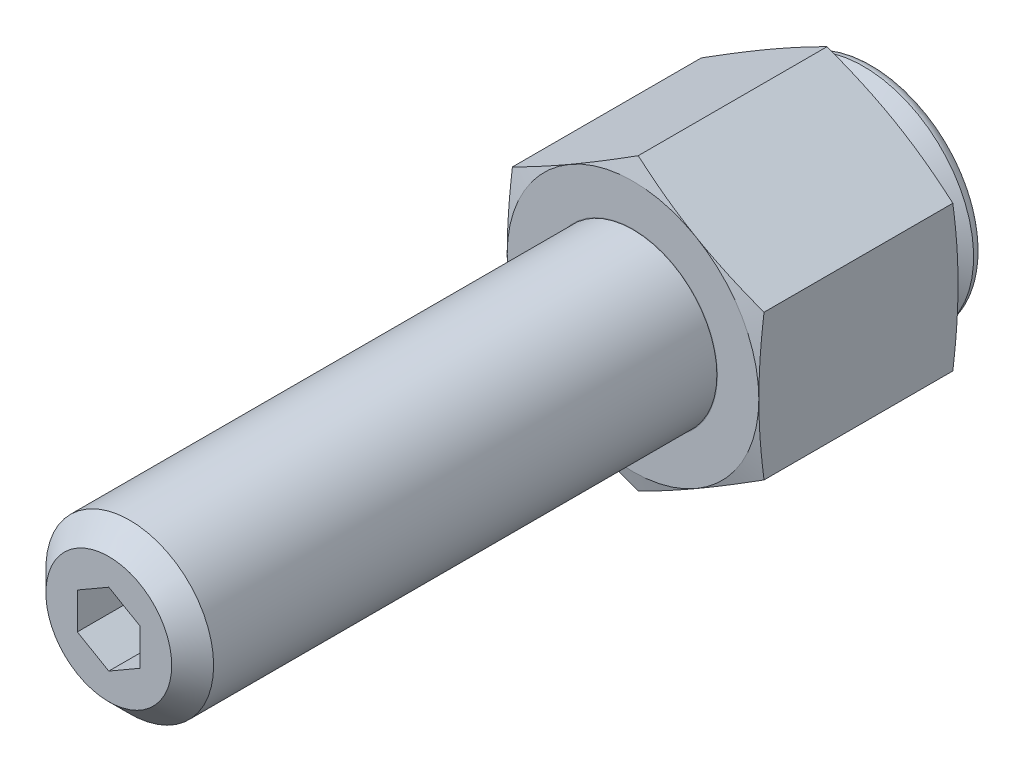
ISO-10303-21;
HEADER;
FILE_DESCRIPTION(('STEP AP214'),'2;1');
FILE_NAME('part.step','',(''),(''),'','','');
FILE_SCHEMA(('AUTOMOTIVE_DESIGN { 1 0 10303 214 1 1 1 1 }'));
ENDSEC;
DATA;
#1=APPLICATION_CONTEXT('core data for automotive mechanical design processes');
#2=APPLICATION_PROTOCOL_DEFINITION('international standard','automotive_design',2000,#1);
#3=PRODUCT_CONTEXT('',#1,'mechanical');
#4=PRODUCT('Part','Part','',(#3));
#5=PRODUCT_RELATED_PRODUCT_CATEGORY('part','',(#4));
#6=PRODUCT_DEFINITION_FORMATION('','',#4);
#7=PRODUCT_DEFINITION_CONTEXT('part definition',#1,'design');
#8=PRODUCT_DEFINITION('design','',#6,#7);
#9=PRODUCT_DEFINITION_SHAPE('','',#8);
#10=(LENGTH_UNIT() NAMED_UNIT(*) SI_UNIT(.MILLI.,.METRE.));
#11=(NAMED_UNIT(*) PLANE_ANGLE_UNIT() SI_UNIT($,.RADIAN.));
#12=(NAMED_UNIT(*) SI_UNIT($,.STERADIAN.) SOLID_ANGLE_UNIT());
#13=UNCERTAINTY_MEASURE_WITH_UNIT(LENGTH_MEASURE(1.E-05),#10,'distance_accuracy_value','');
#14=(GEOMETRIC_REPRESENTATION_CONTEXT(3) GLOBAL_UNCERTAINTY_ASSIGNED_CONTEXT((#13)) GLOBAL_UNIT_ASSIGNED_CONTEXT((#10,
#11,#12)) REPRESENTATION_CONTEXT('',''));
#15=CARTESIAN_POINT('',(0.,0.,0.));
#16=DIRECTION('',(0.,0.,1.));
#17=DIRECTION('',(1.,0.,0.));
#18=AXIS2_PLACEMENT_3D('',#15,#16,#17);
#19=CARTESIAN_POINT('',(0.,0.,8.259600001));
#20=DIRECTION('',(0.,0.,-1.));
#21=DIRECTION('',(-0.159157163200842,0.987253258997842,0.));
#22=AXIS2_PLACEMENT_3D('',#19,#20,#21);
#23=SPHERICAL_SURFACE('',#22,10.);
#24=CARTESIAN_POINT('',(0.,0.,5.778000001));
#25=DIRECTION('',(0.,0.,-1.));
#26=DIRECTION('',(-0.987253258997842,-0.159157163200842,0.));
#27=AXIS2_PLACEMENT_3D('',#24,#25,#26);
#28=CIRCLE('',#27,9.68719058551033);
#29=CARTESIAN_POINT('',(-1.54178577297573,9.56371047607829,5.778000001));
#30=VERTEX_POINT('',#29);
#31=EDGE_CURVE('E9',#30,#30,#28,.F.);
#32=CARTESIAN_POINT('',(0.,0.,3.73430752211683));
#33=DIRECTION('',(0.,0.,1.));
#34=DIRECTION('',(-0.159157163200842,0.987253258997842,0.));
#35=AXIS2_PLACEMENT_3D('',#32,#33,#34);
#36=CIRCLE('',#35,8.91749561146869);
#37=CARTESIAN_POINT('',(-1.41928330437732,8.80382660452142,3.73430752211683));
#38=VERTEX_POINT('',#37);
#39=EDGE_CURVE('E359',#38,#38,#36,.T.);
#40=CARTESIAN_POINT('',(-1.54178577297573,9.56371047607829,5.778000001));
#41=CARTESIAN_POINT('',(-1.54088550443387,9.55812610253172,5.7559193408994));
#42=CARTESIAN_POINT('',(-1.53997321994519,9.55246719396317,5.73385802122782));
#43=CARTESIAN_POINT('',(-1.53812466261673,9.54100057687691,5.68977509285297));
#44=CARTESIAN_POINT('',(-1.53718838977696,9.5351928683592,5.66775348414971));
#45=CARTESIAN_POINT('',(-1.53529189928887,9.52342892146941,5.62375100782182));
#46=CARTESIAN_POINT('',(-1.53433168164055,9.51747268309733,5.60177014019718));
#47=CARTESIAN_POINT('',(-1.53238734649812,9.50541195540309,5.55785017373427));
#48=CARTESIAN_POINT('',(-1.531403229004,9.49930746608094,5.53591107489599));
#49=CARTESIAN_POINT('',(-1.52941114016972,9.48695052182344,5.49207567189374));
#50=CARTESIAN_POINT('',(-1.52840316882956,9.48069806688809,5.47017936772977));
#51=CARTESIAN_POINT('',(-1.52636341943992,9.46804548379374,5.42643057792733));
#52=CARTESIAN_POINT('',(-1.52533164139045,9.46164535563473,5.40457809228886));
#53=CARTESIAN_POINT('',(-1.5232443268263,9.44869772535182,5.36091796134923));
#54=CARTESIAN_POINT('',(-1.52218879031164,9.44215022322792,5.33911031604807));
#55=CARTESIAN_POINT('',(-1.52005400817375,9.42890815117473,5.29554088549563));
#56=CARTESIAN_POINT('',(-1.51897476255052,9.42221358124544,5.27377910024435));
#57=CARTESIAN_POINT('',(-1.51679261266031,9.40867768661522,5.23030240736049));
#58=CARTESIAN_POINT('',(-1.51568970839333,9.40183636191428,5.20858749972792));
#59=CARTESIAN_POINT('',(-1.51346029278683,9.38800727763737,5.16520557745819));
#60=CARTESIAN_POINT('',(-1.5123337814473,9.38101951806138,5.14353856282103));
#61=CARTESIAN_POINT('',(-1.51005720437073,9.366897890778,5.10025343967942));
#62=CARTESIAN_POINT('',(-1.50890713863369,9.35976402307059,5.07863533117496));
#63=CARTESIAN_POINT('',(-1.50658350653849,9.34535051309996,5.03544903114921));
#64=CARTESIAN_POINT('',(-1.50540994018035,9.33807087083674,5.01388083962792));
#65=CARTESIAN_POINT('',(-1.50303936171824,9.32336615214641,4.97079538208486));
#66=CARTESIAN_POINT('',(-1.50184234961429,9.31594107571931,4.9492781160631));
#67=CARTESIAN_POINT('',(-1.49942493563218,9.30094583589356,4.90629551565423));
#68=CARTESIAN_POINT('',(-1.49820453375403,9.29337567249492,4.88483018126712));
#69=CARTESIAN_POINT('',(-1.49574039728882,9.27809061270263,4.84195244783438));
#70=CARTESIAN_POINT('',(-1.49449666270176,9.27037571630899,4.82054004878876));
#71=CARTESIAN_POINT('',(-1.49198591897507,9.25480155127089,4.7777691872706));
#72=CARTESIAN_POINT('',(-1.49071890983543,9.24694228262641,4.75641072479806));
#73=CARTESIAN_POINT('',(-1.4881616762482,9.23107974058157,4.71374873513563));
#74=CARTESIAN_POINT('',(-1.48687145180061,9.2230764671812,4.69244520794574));
#75=CARTESIAN_POINT('',(-1.48426784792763,9.20692628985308,4.64989408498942));
#76=CARTESIAN_POINT('',(-1.48295446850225,9.19877938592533,4.62864648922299));
#77=CARTESIAN_POINT('',(-1.48030461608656,9.18234232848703,4.58620822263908));
#78=CARTESIAN_POINT('',(-1.47896814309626,9.17405217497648,4.56501755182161));
#79=CARTESIAN_POINT('',(-1.47627216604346,9.15732900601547,4.52269412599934));
#80=CARTESIAN_POINT('',(-1.47491266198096,9.148895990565,4.50156137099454));
#81=CARTESIAN_POINT('',(-1.47217068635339,9.13188749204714,4.45935476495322));
#82=CARTESIAN_POINT('',(-1.47078821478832,9.12331200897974,4.4382809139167));
#83=CARTESIAN_POINT('',(-1.46800036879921,9.10601897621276,4.39619310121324));
#84=CARTESIAN_POINT('',(-1.46659499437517,9.09730142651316,4.37517913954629));
#85=CARTESIAN_POINT('',(-1.46376140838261,9.07972466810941,4.33321208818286));
#86=CARTESIAN_POINT('',(-1.46233319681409,9.07086545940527,4.31225899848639));
#87=CARTESIAN_POINT('',(-1.45945400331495,9.05300579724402,4.27041467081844));
#88=CARTESIAN_POINT('',(-1.45800302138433,9.04400534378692,4.24952343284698));
#89=CARTESIAN_POINT('',(-1.45507835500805,9.02586361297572,4.20780378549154));
#90=CARTESIAN_POINT('',(-1.45360467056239,9.01672233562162,4.18697537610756));
#91=CARTESIAN_POINT('',(-1.45063466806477,8.99829938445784,4.14538235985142));
#92=CARTESIAN_POINT('',(-1.4491383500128,8.98901771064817,4.12461775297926));
#93=CARTESIAN_POINT('',(-1.44612315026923,8.97031440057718,4.0831533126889));
#94=CARTESIAN_POINT('',(-1.44460426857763,8.96089276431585,4.0624534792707));
#95=CARTESIAN_POINT('',(-1.44154401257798,8.94190996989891,4.02111955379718));
#96=CARTESIAN_POINT('',(-1.44000263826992,8.93234881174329,4.00048546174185));
#97=CARTESIAN_POINT('',(-1.43689746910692,8.9130874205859,3.95928398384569));
#98=CARTESIAN_POINT('',(-1.43533367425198,8.90338718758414,3.93871659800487));
#99=CARTESIAN_POINT('',(-1.43218373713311,8.88384810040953,3.89764949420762));
#100=CARTESIAN_POINT('',(-1.43059759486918,8.87400924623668,3.87714977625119));
#101=CARTESIAN_POINT('',(-1.42740303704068,8.85419337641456,3.83621896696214));
#102=CARTESIAN_POINT('',(-1.4257946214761,8.84421636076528,3.8157878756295));
#103=CARTESIAN_POINT('',(-1.42255559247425,8.82412463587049,3.77499527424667));
#104=CARTESIAN_POINT('',(-1.42092497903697,8.81400992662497,3.75463376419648));
#105=CARTESIAN_POINT('',(-1.41928330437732,8.80382660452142,3.73430752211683));
#106=B_SPLINE_CURVE_WITH_KNOTS('',3,(#40,#41,#42,#43,#44,#45,#46,#47,#48,#49,#50,#51,#52,#53,
#54,#55,#56,#57,#58,#59,#60,#61,#62,#63,#64,#65,#66,#67,#68,#69,#70,#71,#72,#73,#74,#75,#76,#77,
#78,#79,#80,#81,#82,#83,#84,#85,#86,#87,#88,#89,#90,#91,#92,#93,#94,#95,#96,#97,#98,#99,#100,
#101,#102,#103,#104,#105),.UNSPECIFIED.,.F.,.F.,(4,2,2,2,2,2,2,2,2,2,2,2,2,2,2,2,2,2,2,2,2,2,2,
2,2,2,2,2,2,2,2,2,4),(0.,0.0683808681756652,0.13676173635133,0.205142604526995,
0.273523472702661,0.341904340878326,0.410285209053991,0.478666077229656,0.547046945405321,
0.615427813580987,0.683808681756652,0.752189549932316,0.820570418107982,0.888951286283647,
0.957332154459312,1.02571302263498,1.09409389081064,1.16247475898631,1.23085562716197,
1.29923649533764,1.3676173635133,1.43599823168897,1.50437909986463,1.5727599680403,
1.64114083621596,1.70952170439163,1.77790257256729,1.84628344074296,1.91466430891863,
1.98304517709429,2.05142604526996,2.11980691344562,2.18818778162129),.UNSPECIFIED.);
#107=EDGE_CURVE('BSEAM14',#30,#38,#106,.T.);
#108=ORIENTED_EDGE('',*,*,#31,.F.);
#109=ORIENTED_EDGE('',*,*,#39,.T.);
#110=ORIENTED_EDGE('',*,*,#107,.T.);
#111=ORIENTED_EDGE('',*,*,#107,.F.);
#112=EDGE_LOOP('',(#108,#110,#109,#111));
#113=FACE_BOUND('',#112,.T.);
#114=ADVANCED_FACE('F14',(#113),#23,.T.);
#115=CARTESIAN_POINT('',(0.,0.,0.));
#116=DIRECTION('',(0.,0.,-1.));
#117=DIRECTION('',(0.159157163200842,-0.987253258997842,0.));
#118=AXIS2_PLACEMENT_3D('',#115,#116,#117);
#119=CYLINDRICAL_SURFACE('',#118,8.89);
#120=CARTESIAN_POINT('',(0.,0.,3.6193650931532));
#121=DIRECTION('',(0.,0.,1.));
#122=DIRECTION('',(-0.159157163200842,0.987253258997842,0.));
#123=AXIS2_PLACEMENT_3D('',#120,#121,#122);
#124=CIRCLE('',#123,8.89);
#125=CARTESIAN_POINT('',(-1.41490718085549,8.77668147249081,3.6193650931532));
#126=VERTEX_POINT('',#125);
#127=EDGE_CURVE('E357',#126,#126,#124,.F.);
#128=ORIENTED_EDGE('',*,*,#127,.T.);
#129=EDGE_LOOP('',(#128));
#130=FACE_BOUND('',#129,.T.);
#131=CARTESIAN_POINT('',(0.,0.,2.09218090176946));
#132=DIRECTION('',(0.,0.,-1.));
#133=DIRECTION('',(0.159157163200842,-0.987253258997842,0.));
#134=AXIS2_PLACEMENT_3D('',#131,#132,#133);
#135=CIRCLE('',#134,8.89);
#136=CARTESIAN_POINT('',(1.41490718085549,-8.77668147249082,2.09218090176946));
#137=VERTEX_POINT('',#136);
#138=EDGE_CURVE('E354',#137,#137,#135,.F.);
#139=ORIENTED_EDGE('',*,*,#138,.T.);
#140=EDGE_LOOP('',(#139));
#141=FACE_BOUND('',#140,.T.);
#142=ADVANCED_FACE('F477',(#130,#141),#119,.T.);
#143=CARTESIAN_POINT('',(0.,0.,1.94553393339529));
#144=DIRECTION('',(0.,0.,-1.));
#145=DIRECTION('',(0.159157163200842,-0.987253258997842,0.));
#146=AXIS2_PLACEMENT_3D('',#143,#144,#145);
#147=CONICAL_SURFACE('',#146,8.89,1.0471975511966);
#148=CARTESIAN_POINT('',(0.,0.,1.87221044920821));
#149=DIRECTION('',(0.,0.,-1.));
#150=DIRECTION('',(0.159157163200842,-0.987253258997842,0.));
#151=AXIS2_PLACEMENT_3D('',#148,#149,#150);
#152=CIRCLE('',#151,9.017);
#153=CARTESIAN_POINT('',(1.43512014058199,-8.90206263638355,1.87221044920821));
#154=VERTEX_POINT('',#153);
#155=EDGE_CURVE('E18',#154,#154,#152,.T.);
#156=ORIENTED_EDGE('',*,*,#155,.T.);
#157=EDGE_LOOP('',(#156));
#158=FACE_BOUND('',#157,.T.);
#159=CARTESIAN_POINT('',(0.,0.,1.016));
#160=DIRECTION('',(0.,0.,-1.));
#161=DIRECTION('',(0.159157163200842,-0.987253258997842,0.));
#162=AXIS2_PLACEMENT_3D('',#159,#160,#161);
#163=CIRCLE('',#162,10.5);
#164=CARTESIAN_POINT('',(1.67115021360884,-10.3661592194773,1.016));
#165=VERTEX_POINT('',#164);
#166=EDGE_CURVE('E188',#165,#165,#163,.T.);
#167=ORIENTED_EDGE('',*,*,#166,.F.);
#168=EDGE_LOOP('',(#167));
#169=FACE_BOUND('',#168,.T.);
#170=ADVANCED_FACE('F366',(#158,#169),#147,.T.);
#171=CARTESIAN_POINT('',(-1.67115021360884,10.3661592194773,0.));
#172=DIRECTION('',(0.,0.,1.));
#173=DIRECTION('',(-0.159157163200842,0.987253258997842,0.));
#174=AXIS2_PLACEMENT_3D('',#171,#172,#173);
#175=PLANE('',#174);
#176=CARTESIAN_POINT('',(0.,0.,0.));
#177=DIRECTION('',(0.,0.,1.));
#178=DIRECTION('',(-0.159157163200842,0.987253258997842,0.));
#179=AXIS2_PLACEMENT_3D('',#176,#177,#178);
#180=CIRCLE('',#179,9.484);
#181=CARTESIAN_POINT('',(-1.50944653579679,9.36310990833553,0.));
#182=VERTEX_POINT('',#181);
#183=EDGE_CURVE('E351',#182,#182,#180,.F.);
#184=ORIENTED_EDGE('',*,*,#183,.T.);
#185=EDGE_LOOP('',(#184));
#186=FACE_BOUND('',#185,.T.);
#187=ADVANCED_FACE('F471',(#186),#175,.F.);
#188=CARTESIAN_POINT('',(0.,0.,1.016));
#189=DIRECTION('',(0.,0.,1.));
#190=DIRECTION('',(-0.159157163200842,0.987253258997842,0.));
#191=AXIS2_PLACEMENT_3D('',#188,#189,#190);
#192=TOROIDAL_SURFACE('',#191,9.484,1.016);
#193=ORIENTED_EDGE('',*,*,#166,.T.);
#194=EDGE_LOOP('',(#193));
#195=FACE_BOUND('',#194,.T.);
#196=ORIENTED_EDGE('',*,*,#183,.F.);
#197=EDGE_LOOP('',(#196));
#198=FACE_BOUND('',#197,.T.);
#199=ADVANCED_FACE('F381',(#195,#198),#192,.T.);
#200=CARTESIAN_POINT('',(0.,0.,3.6193650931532));
#201=DIRECTION('',(0.,0.,1.));
#202=DIRECTION('',(-0.159157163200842,0.987253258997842,0.));
#203=AXIS2_PLACEMENT_3D('',#200,#201,#202);
#204=TOROIDAL_SURFACE('',#203,9.144,0.254);
#205=ORIENTED_EDGE('',*,*,#39,.F.);
#206=EDGE_LOOP('',(#205));
#207=FACE_BOUND('',#206,.T.);
#208=ORIENTED_EDGE('',*,*,#127,.F.);
#209=EDGE_LOOP('',(#208));
#210=FACE_BOUND('',#209,.T.);
#211=ADVANCED_FACE('F371',(#207,#210),#204,.F.);
#212=CARTESIAN_POINT('',(0.,0.,2.09218090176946));
#213=DIRECTION('',(0.,0.,-1.));
#214=DIRECTION('',(0.159157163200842,-0.987253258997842,0.));
#215=AXIS2_PLACEMENT_3D('',#212,#213,#214);
#216=TOROIDAL_SURFACE('',#215,9.144,0.254);
#217=ORIENTED_EDGE('',*,*,#138,.F.);
#218=EDGE_LOOP('',(#217));
#219=FACE_BOUND('',#218,.T.);
#220=ORIENTED_EDGE('',*,*,#155,.F.);
#221=EDGE_LOOP('',(#220));
#222=FACE_BOUND('',#221,.T.);
#223=ADVANCED_FACE('F16',(#219,#222),#216,.F.);
#224=CARTESIAN_POINT('',(0.,0.,73.000000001));
#225=DIRECTION('',(0.,0.,1.));
#226=DIRECTION('',(1.,0.,0.));
#227=AXIS2_PLACEMENT_3D('',#224,#225,#226);
#228=PLANE('',#227);
#229=DIRECTION('',(-0.866025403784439,0.5,0.));
#230=VECTOR('',#229,1.);
#231=CARTESIAN_POINT('',(3.,1.73205080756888,73.000000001));
#232=LINE('',#231,#230);
#233=CARTESIAN_POINT('',(3.,1.73205080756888,73.000000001));
#234=VERTEX_POINT('',#233);
#235=CARTESIAN_POINT('',(0.,3.46410161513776,73.000000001));
#236=VERTEX_POINT('',#235);
#237=EDGE_CURVE('E31',#234,#236,#232,.T.);
#238=ORIENTED_EDGE('',*,*,#237,.F.);
#239=DIRECTION('',(0.,1.,0.));
#240=VECTOR('',#239,1.);
#241=CARTESIAN_POINT('',(3.,-1.73205080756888,73.000000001));
#242=LINE('',#241,#240);
#243=CARTESIAN_POINT('',(3.,-1.73205080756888,73.000000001));
#244=VERTEX_POINT('',#243);
#245=EDGE_CURVE('E162',#244,#234,#242,.T.);
#246=ORIENTED_EDGE('',*,*,#245,.F.);
#247=DIRECTION('',(0.866025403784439,0.5,0.));
#248=VECTOR('',#247,1.);
#249=CARTESIAN_POINT('',(0.,-3.46410161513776,73.000000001));
#250=LINE('',#249,#248);
#251=CARTESIAN_POINT('',(0.,-3.46410161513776,73.000000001));
#252=VERTEX_POINT('',#251);
#253=EDGE_CURVE('E165',#252,#244,#250,.T.);
#254=ORIENTED_EDGE('',*,*,#253,.F.);
#255=DIRECTION('',(0.866025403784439,-0.5,0.));
#256=VECTOR('',#255,1.);
#257=CARTESIAN_POINT('',(-3.,-1.73205080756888,73.000000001));
#258=LINE('',#257,#256);
#259=CARTESIAN_POINT('',(-3.,-1.73205080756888,73.000000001));
#260=VERTEX_POINT('',#259);
#261=EDGE_CURVE('E181',#260,#252,#258,.T.);
#262=ORIENTED_EDGE('',*,*,#261,.F.);
#263=DIRECTION('',(0.,-1.,0.));
#264=VECTOR('',#263,1.);
#265=CARTESIAN_POINT('',(-3.,1.73205080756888,73.000000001));
#266=LINE('',#265,#264);
#267=CARTESIAN_POINT('',(-3.,1.73205080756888,73.000000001));
#268=VERTEX_POINT('',#267);
#269=EDGE_CURVE('E178',#268,#260,#266,.T.);
#270=ORIENTED_EDGE('',*,*,#269,.F.);
#271=DIRECTION('',(-0.866025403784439,-0.5,0.));
#272=VECTOR('',#271,1.);
#273=CARTESIAN_POINT('',(0.,3.46410161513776,73.000000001));
#274=LINE('',#273,#272);
#275=EDGE_CURVE('E176',#236,#268,#274,.T.);
#276=ORIENTED_EDGE('',*,*,#275,.F.);
#277=EDGE_LOOP('',(#238,#246,#254,#262,#270,#276));
#278=FACE_BOUND('',#277,.T.);
#279=CARTESIAN_POINT('',(0.,0.,73.000000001));
#280=DIRECTION('',(0.,0.,1.));
#281=DIRECTION('',(1.,0.,0.));
#282=AXIS2_PLACEMENT_3D('',#279,#280,#281);
#283=CIRCLE('',#282,6.);
#284=CARTESIAN_POINT('',(6.,0.,73.000000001));
#285=VERTEX_POINT('',#284);
#286=EDGE_CURVE('E344',#285,#285,#283,.T.);
#287=ORIENTED_EDGE('',*,*,#286,.T.);
#288=EDGE_LOOP('',(#287));
#289=FACE_BOUND('',#288,.T.);
#290=ADVANCED_FACE('F370',(#278,#289),#228,.T.);
#291=CARTESIAN_POINT('',(0.,0.,73.000000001));
#292=DIRECTION('',(0.,0.,-1.));
#293=DIRECTION('',(-1.,0.,0.));
#294=AXIS2_PLACEMENT_3D('',#291,#292,#293);
#295=CONICAL_SURFACE('',#294,6.,0.785398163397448);
#296=CARTESIAN_POINT('',(0.,0.,71.000000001));
#297=DIRECTION('',(0.,0.,1.));
#298=DIRECTION('',(1.,0.,0.));
#299=AXIS2_PLACEMENT_3D('',#296,#297,#298);
#300=CIRCLE('',#299,8.);
#301=CARTESIAN_POINT('',(8.,0.,71.000000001));
#302=VERTEX_POINT('',#301);
#303=EDGE_CURVE('E23',#302,#302,#300,.F.);
#304=ORIENTED_EDGE('',*,*,#303,.F.);
#305=EDGE_LOOP('',(#304));
#306=FACE_BOUND('',#305,.T.);
#307=ORIENTED_EDGE('',*,*,#286,.F.);
#308=EDGE_LOOP('',(#307));
#309=FACE_BOUND('',#308,.T.);
#310=ADVANCED_FACE('F378',(#306,#309),#295,.T.);
#311=CARTESIAN_POINT('',(0.,0.,73.000000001));
#312=DIRECTION('',(0.,0.,-1.));
#313=DIRECTION('',(-1.,0.,0.));
#314=AXIS2_PLACEMENT_3D('',#311,#312,#313);
#315=CYLINDRICAL_SURFACE('',#314,8.);
#316=ORIENTED_EDGE('',*,*,#303,.T.);
#317=EDGE_LOOP('',(#316));
#318=FACE_BOUND('',#317,.T.);
#319=CARTESIAN_POINT('',(0.,0.,23.0008805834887));
#320=DIRECTION('',(0.,0.,1.));
#321=DIRECTION('',(1.,0.,0.));
#322=AXIS2_PLACEMENT_3D('',#319,#320,#321);
#323=CIRCLE('',#322,8.);
#324=CARTESIAN_POINT('',(8.,0.,23.0008805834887));
#325=VERTEX_POINT('',#324);
#326=EDGE_CURVE('E199',#325,#325,#323,.F.);
#327=ORIENTED_EDGE('',*,*,#326,.F.);
#328=EDGE_LOOP('',(#327));
#329=FACE_BOUND('',#328,.T.);
#330=ADVANCED_FACE('F399',(#318,#329),#315,.T.);
#331=CARTESIAN_POINT('',(0.,0.,24.524000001));
#332=DIRECTION('',(0.,0.,-1.));
#333=DIRECTION('',(-1.,0.,0.));
#334=AXIS2_PLACEMENT_3D('',#331,#332,#333);
#335=TOROIDAL_SURFACE('',#334,8.0518,1.524);
#336=ORIENTED_EDGE('',*,*,#326,.T.);
#337=EDGE_LOOP('',(#336));
#338=FACE_BOUND('',#337,.T.);
#339=CARTESIAN_POINT('',(0.,0.,23.000000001));
#340=DIRECTION('',(0.,0.,-1.));
#341=DIRECTION('',(-1.,0.,0.));
#342=AXIS2_PLACEMENT_3D('',#339,#340,#341);
#343=CIRCLE('',#342,8.0518);
#344=CARTESIAN_POINT('',(-8.0518,0.,23.000000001));
#345=VERTEX_POINT('',#344);
#346=EDGE_CURVE('E341',#345,#345,#343,.T.);
#347=ORIENTED_EDGE('',*,*,#346,.F.);
#348=EDGE_LOOP('',(#347));
#349=FACE_BOUND('',#348,.T.);
#350=ADVANCED_FACE('F401',(#338,#349),#335,.F.);
#351=CARTESIAN_POINT('',(-12.,20.7846096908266,23.000000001));
#352=DIRECTION('',(0.,0.,-1.));
#353=DIRECTION('',(-1.,0.,0.));
#354=AXIS2_PLACEMENT_3D('',#351,#352,#353);
#355=PLANE('',#354);
#356=CARTESIAN_POINT('',(0.,0.,23.000000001));
#357=DIRECTION('',(0.,0.,-1.));
#358=DIRECTION('',(-1.,0.,0.));
#359=AXIS2_PLACEMENT_3D('',#356,#357,#358);
#360=CIRCLE('',#359,12.);
#361=CARTESIAN_POINT('',(-12.,0.,23.000000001));
#362=VERTEX_POINT('',#361);
#363=CARTESIAN_POINT('',(-6.,10.3923048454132,23.000000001));
#364=VERTEX_POINT('',#363);
#365=EDGE_CURVE('E431',#362,#364,#360,.T.);
#366=ORIENTED_EDGE('',*,*,#365,.F.);
#367=CARTESIAN_POINT('',(0.,0.,23.000000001));
#368=DIRECTION('',(0.,0.,-1.));
#369=DIRECTION('',(-1.,0.,0.));
#370=AXIS2_PLACEMENT_3D('',#367,#368,#369);
#371=CIRCLE('',#370,12.);
#372=CARTESIAN_POINT('',(-6.,-10.3923048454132,23.000000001));
#373=VERTEX_POINT('',#372);
#374=EDGE_CURVE('E310',#373,#362,#371,.T.);
#375=ORIENTED_EDGE('',*,*,#374,.F.);
#376=CARTESIAN_POINT('',(6.,-10.3923048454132,23.000000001));
#377=VERTEX_POINT('',#376);
#378=EDGE_CURVE('E328',#377,#373,#371,.T.);
#379=ORIENTED_EDGE('',*,*,#378,.F.);
#380=CARTESIAN_POINT('',(12.,0.,23.000000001));
#381=VERTEX_POINT('',#380);
#382=EDGE_CURVE('E827',#381,#377,#371,.T.);
#383=ORIENTED_EDGE('',*,*,#382,.F.);
#384=CARTESIAN_POINT('',(6.,10.3923048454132,23.000000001));
#385=VERTEX_POINT('',#384);
#386=EDGE_CURVE('E814',#385,#381,#371,.T.);
#387=ORIENTED_EDGE('',*,*,#386,.F.);
#388=EDGE_CURVE('E329',#364,#385,#371,.T.);
#389=ORIENTED_EDGE('',*,*,#388,.F.);
#390=EDGE_LOOP('',(#366,#375,#379,#383,#387,#389));
#391=FACE_BOUND('',#390,.T.);
#392=ORIENTED_EDGE('',*,*,#346,.T.);
#393=EDGE_LOOP('',(#392));
#394=FACE_BOUND('',#393,.T.);
#395=ADVANCED_FACE('F407',(#391,#394),#355,.F.);
#396=CARTESIAN_POINT('',(0.,0.,21.5858363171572));
#397=DIRECTION('',(0.,0.,-1.));
#398=DIRECTION('',(-1.,0.,0.));
#399=AXIS2_PLACEMENT_3D('',#396,#397,#398);
#400=CONICAL_SURFACE('',#399,17.2777307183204,1.30899693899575);
#401=CARTESIAN_POINT('',(12.,-18.3832707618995,20.3330380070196));
#402=CARTESIAN_POINT('',(12.,-17.8382256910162,20.4553004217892));
#403=CARTESIAN_POINT('',(12.,-17.2928412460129,20.5760768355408));
#404=CARTESIAN_POINT('',(12.,-16.2012268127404,20.8138554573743));
#405=CARTESIAN_POINT('',(12.,-15.6549967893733,20.9308575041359));
#406=CARTESIAN_POINT('',(12.,-14.5610430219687,21.1603853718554));
#407=CARTESIAN_POINT('',(12.,-14.013318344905,21.2729067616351));
#408=CARTESIAN_POINT('',(12.,-12.9167329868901,21.4922676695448));
#409=CARTESIAN_POINT('',(12.,-12.3678723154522,21.5991072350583));
#410=CARTESIAN_POINT('',(12.,-11.2731971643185,21.8049261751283));
#411=CARTESIAN_POINT('',(12.,-10.7273932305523,21.9039613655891));
#412=CARTESIAN_POINT('',(12.,-9.6342857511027,22.0934489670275));
#413=CARTESIAN_POINT('',(12.,-9.08698219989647,22.1839013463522));
#414=CARTESIAN_POINT('',(12.,-7.99078335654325,22.3541945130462));
#415=CARTESIAN_POINT('',(12.,-7.44188827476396,22.4340366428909));
#416=CARTESIAN_POINT('',(12.,-6.34234963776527,22.5807679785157));
#417=CARTESIAN_POINT('',(12.,-5.79170608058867,22.6476571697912));
#418=CARTESIAN_POINT('',(12.,-4.68243430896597,22.7666008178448));
#419=CARTESIAN_POINT('',(12.,-4.12378671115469,22.8184771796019));
#420=CARTESIAN_POINT('',(12.,-3.00507508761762,22.9038237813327));
#421=CARTESIAN_POINT('',(12.,-2.44501109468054,22.9372944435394));
#422=CARTESIAN_POINT('',(12.,-1.32428091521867,22.9838781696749));
#423=CARTESIAN_POINT('',(12.,-0.763615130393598,22.997000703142));
#424=CARTESIAN_POINT('',(12.,0.35781356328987,23.0020801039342));
#425=CARTESIAN_POINT('',(12.,0.918576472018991,22.9940369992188));
#426=CARTESIAN_POINT('',(12.,2.04146017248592,22.9572367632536));
#427=CARTESIAN_POINT('',(12.,2.60357843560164,22.9284040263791));
#428=CARTESIAN_POINT('',(12.,3.72650038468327,22.8516752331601));
#429=CARTESIAN_POINT('',(12.,4.28730404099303,22.8037787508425));
#430=CARTESIAN_POINT('',(12.,5.40759098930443,22.6913556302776));
#431=CARTESIAN_POINT('',(12.,5.96707316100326,22.6268180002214));
#432=CARTESIAN_POINT('',(12.,7.08423471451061,22.4838151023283));
#433=CARTESIAN_POINT('',(12.,7.64191409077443,22.4053497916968));
#434=CARTESIAN_POINT('',(12.,8.72392663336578,22.241794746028));
#435=CARTESIAN_POINT('',(12.,9.24835581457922,22.1573338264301));
#436=CARTESIAN_POINT('',(12.,10.2958159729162,21.9801069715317));
#437=CARTESIAN_POINT('',(12.,10.8188469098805,21.8873408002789));
#438=CARTESIAN_POINT('',(12.,11.8637124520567,21.6950349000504));
#439=CARTESIAN_POINT('',(12.,12.3855469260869,21.5954944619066));
#440=CARTESIAN_POINT('',(12.,13.4281250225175,21.3909013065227));
#441=CARTESIAN_POINT('',(12.,13.9488686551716,21.2858486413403));
#442=CARTESIAN_POINT('',(12.,14.989554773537,21.0712098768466));
#443=CARTESIAN_POINT('',(12.,15.5094970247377,20.961622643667));
#444=CARTESIAN_POINT('',(12.,16.5485863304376,20.7387355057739));
#445=CARTESIAN_POINT('',(12.,17.0677333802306,20.6254355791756));
#446=CARTESIAN_POINT('',(12.,18.6240890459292,20.2809782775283));
#447=CARTESIAN_POINT('',(12.,19.660285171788,20.0452481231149));
#448=CARTESIAN_POINT('',(12.,21.720435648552,19.567687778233));
#449=CARTESIAN_POINT('',(12.,22.7444095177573,19.32594123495));
#450=CARTESIAN_POINT('',(12.,24.7909351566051,18.8364279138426));
#451=CARTESIAN_POINT('',(12.,25.8134868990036,18.5886610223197));
#452=CARTESIAN_POINT('',(12.,27.8562043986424,18.0889953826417));
#453=CARTESIAN_POINT('',(12.,28.8763715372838,17.837102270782));
#454=CARTESIAN_POINT('',(12.,30.4059760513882,17.4567401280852));
#455=CARTESIAN_POINT('',(12.,30.9157281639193,17.3295344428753));
#456=CARTESIAN_POINT('',(12.,31.9350454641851,17.0743785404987));
#457=CARTESIAN_POINT('',(12.,32.4446106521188,16.9464283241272));
#458=CARTESIAN_POINT('',(12.,32.9540943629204,16.8181545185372));
#459=B_SPLINE_CURVE_WITH_KNOTS('',3,(#401,#402,#403,#404,#405,#406,#407,#408,#409,#410,#411,
#412,#413,#414,#415,#416,#417,#418,#419,#420,#421,#422,#423,#424,#425,#426,#427,#428,#429,#430,
#431,#432,#433,#434,#435,#436,#437,#438,#439,#440,#441,#442,#443,#444,#445,#446,#447,#448,#449,
#450,#451,#452,#453,#454,#455,#456,#457,#458),.UNSPECIFIED.,.F.,.F.,(4,2,2,2,2,2,2,2,2,2,2,2,2,
2,2,2,2,2,2,2,2,2,2,2,2,2,2,2,4),(0.,1.67577524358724,3.35162201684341,5.02908693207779,
6.70653785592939,8.37063128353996,10.0347308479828,11.6986196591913,13.3625103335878,
15.0453984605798,16.7282479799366,18.4103141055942,20.0923780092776,21.7805901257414,
23.4688399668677,25.1582077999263,26.8475808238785,28.4410626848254,30.0345898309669,
31.6282840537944,33.2219632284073,34.8160433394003,36.4101328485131,39.5980881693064,
42.7544374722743,45.9108464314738,49.063253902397,50.6394059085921,52.2155562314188),.UNSPECIFIED.);
#460=CARTESIAN_POINT('',(12.,-6.92820323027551,22.5025773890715));
#461=VERTEX_POINT('',#460);
#462=EDGE_CURVE('E306',#381,#461,#459,.F.);
#463=ORIENTED_EDGE('',*,*,#462,.F.);
#464=ORIENTED_EDGE('',*,*,#382,.T.);
#465=CARTESIAN_POINT('',(12.0002,-6.92808776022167,22.502546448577));
#466=CARTESIAN_POINT('',(11.5018535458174,-7.21580821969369,22.5796720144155));
#467=CARTESIAN_POINT('',(11.0026035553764,-7.50405033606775,22.6496892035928));
#468=CARTESIAN_POINT('',(10.0023405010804,-8.08155247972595,22.7727027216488));
#469=CARTESIAN_POINT('',(9.50132680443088,-8.37081287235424,22.8256921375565));
#470=CARTESIAN_POINT('',(8.50057386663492,-8.94859785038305,22.9115567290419));
#471=CARTESIAN_POINT('',(8.00084139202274,-9.23711852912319,22.944534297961));
#472=CARTESIAN_POINT('',(7.00073918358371,-9.8145278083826,22.9887538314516));
#473=CARTESIAN_POINT('',(6.50036959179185,-10.1034163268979,23.000000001));
#474=CARTESIAN_POINT('',(5.49963040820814,-10.6811933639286,23.000000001));
#475=CARTESIAN_POINT('',(4.99926081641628,-10.9700818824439,22.9887538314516));
#476=CARTESIAN_POINT('',(3.99915860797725,-11.5474911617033,22.944534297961));
#477=CARTESIAN_POINT('',(3.49942613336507,-11.8360118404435,22.9115567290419));
#478=CARTESIAN_POINT('',(2.49867319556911,-12.4137968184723,22.8256921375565));
#479=CARTESIAN_POINT('',(1.99765949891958,-12.7030572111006,22.7727027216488));
#480=CARTESIAN_POINT('',(0.997396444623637,-13.2805593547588,22.6496892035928));
#481=CARTESIAN_POINT('',(0.498146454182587,-13.5688014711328,22.5796720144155));
#482=CARTESIAN_POINT('',(-0.000200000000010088,-13.8565219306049,22.502546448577));
#483=B_SPLINE_CURVE_WITH_KNOTS('',3,(#465,#466,#467,#468,#469,#470,#471,#472,#473,#474,#475,
#476,#477,#478,#479,#480,#481,#482),.UNSPECIFIED.,.F.,.F.,(4,2,2,2,2,2,2,2,4),(0.,
1.74185054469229,3.48440735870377,5.21797126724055,6.95119970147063,8.6844281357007,
10.4179920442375,12.160548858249,13.9023994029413),.UNSPECIFIED.);
#484=EDGE_CURVE('E305',#461,#377,#483,.T.);
#485=ORIENTED_EDGE('',*,*,#484,.F.);
#486=EDGE_LOOP('',(#463,#464,#485));
#487=FACE_BOUND('',#486,.T.);
#488=ADVANCED_FACE('F419',(#487),#400,.T.);
#489=CARTESIAN_POINT('',(-0.000200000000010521,13.8565219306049,22.502546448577));
#490=CARTESIAN_POINT('',(0.498146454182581,13.5688014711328,22.5796720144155));
#491=CARTESIAN_POINT('',(0.997396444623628,13.2805593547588,22.6496892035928));
#492=CARTESIAN_POINT('',(1.99765949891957,12.7030572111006,22.7727027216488));
#493=CARTESIAN_POINT('',(2.4986731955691,12.4137968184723,22.8256921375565));
#494=CARTESIAN_POINT('',(3.49942613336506,11.8360118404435,22.9115567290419));
#495=CARTESIAN_POINT('',(3.99915860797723,11.5474911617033,22.944534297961));
#496=CARTESIAN_POINT('',(4.99926081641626,10.9700818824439,22.9887538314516));
#497=CARTESIAN_POINT('',(5.49963040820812,10.6811933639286,23.000000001));
#498=CARTESIAN_POINT('',(6.50036959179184,10.1034163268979,23.000000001));
#499=CARTESIAN_POINT('',(7.0007391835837,9.81452780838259,22.9887538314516));
#500=CARTESIAN_POINT('',(8.00084139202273,9.23711852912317,22.944534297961));
#501=CARTESIAN_POINT('',(8.50057386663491,8.94859785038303,22.9115567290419));
#502=CARTESIAN_POINT('',(9.50132680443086,8.37081287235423,22.8256921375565));
#503=CARTESIAN_POINT('',(10.0023405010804,8.08155247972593,22.7727027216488));
#504=CARTESIAN_POINT('',(11.0026035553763,7.50405033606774,22.6496892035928));
#505=CARTESIAN_POINT('',(11.5018535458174,7.21580821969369,22.5796720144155));
#506=CARTESIAN_POINT('',(12.0002,6.92808776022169,22.502546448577));
#507=B_SPLINE_CURVE_WITH_KNOTS('',3,(#489,#490,#491,#492,#493,#494,#495,#496,#497,#498,#499,
#500,#501,#502,#503,#504,#505,#506),.UNSPECIFIED.,.F.,.F.,(4,2,2,2,2,2,2,2,4),(0.,
1.74185054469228,3.48440735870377,5.21797126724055,6.95119970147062,8.6844281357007,
10.4179920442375,12.160548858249,13.9023994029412),.UNSPECIFIED.);
#508=CARTESIAN_POINT('',(12.,6.92820323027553,22.5025773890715));
#509=VERTEX_POINT('',#508);
#510=EDGE_CURVE('E450',#385,#509,#507,.T.);
#511=ORIENTED_EDGE('',*,*,#510,.F.);
#512=ORIENTED_EDGE('',*,*,#386,.T.);
#513=EDGE_CURVE('E292',#509,#381,#459,.F.);
#514=ORIENTED_EDGE('',*,*,#513,.F.);
#515=EDGE_LOOP('',(#511,#512,#514));
#516=FACE_BOUND('',#515,.T.);
#517=ADVANCED_FACE('F424',(#516),#400,.T.);
#518=CARTESIAN_POINT('',(-12.0002,6.92808776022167,22.502546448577));
#519=CARTESIAN_POINT('',(-11.5018535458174,7.21580821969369,22.5796720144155));
#520=CARTESIAN_POINT('',(-11.0026035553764,7.50405033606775,22.6496892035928));
#521=CARTESIAN_POINT('',(-10.0023405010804,8.08155247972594,22.7727027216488));
#522=CARTESIAN_POINT('',(-9.50132680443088,8.37081287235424,22.8256921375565));
#523=CARTESIAN_POINT('',(-8.50057386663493,8.94859785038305,22.9115567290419));
#524=CARTESIAN_POINT('',(-8.00084139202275,9.23711852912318,22.944534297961));
#525=CARTESIAN_POINT('',(-7.00073918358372,9.8145278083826,22.9887538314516));
#526=CARTESIAN_POINT('',(-6.50036959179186,10.1034163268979,23.000000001));
#527=CARTESIAN_POINT('',(-5.49963040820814,10.6811933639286,23.000000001));
#528=CARTESIAN_POINT('',(-4.99926081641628,10.9700818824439,22.9887538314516));
#529=CARTESIAN_POINT('',(-3.99915860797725,11.5474911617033,22.944534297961));
#530=CARTESIAN_POINT('',(-3.49942613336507,11.8360118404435,22.9115567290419));
#531=CARTESIAN_POINT('',(-2.49867319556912,12.4137968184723,22.8256921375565));
#532=CARTESIAN_POINT('',(-1.99765949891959,12.7030572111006,22.7727027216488));
#533=CARTESIAN_POINT('',(-0.997396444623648,13.2805593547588,22.6496892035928));
#534=CARTESIAN_POINT('',(-0.498146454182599,13.5688014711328,22.5796720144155));
#535=CARTESIAN_POINT('',(0.000199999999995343,13.8565219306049,22.502546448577));
#536=B_SPLINE_CURVE_WITH_KNOTS('',3,(#518,#519,#520,#521,#522,#523,#524,#525,#526,#527,#528,
#529,#530,#531,#532,#533,#534,#535),.UNSPECIFIED.,.F.,.F.,(4,2,2,2,2,2,2,2,4),(0.,
1.74185054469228,3.48440735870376,5.21797126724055,6.95119970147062,8.6844281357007,
10.4179920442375,12.160548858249,13.9023994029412),.UNSPECIFIED.);
#537=CARTESIAN_POINT('',(0.,13.856406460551,22.5025773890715));
#538=VERTEX_POINT('',#537);
#539=EDGE_CURVE('E439',#364,#538,#536,.T.);
#540=ORIENTED_EDGE('',*,*,#539,.F.);
#541=ORIENTED_EDGE('',*,*,#388,.T.);
#542=EDGE_CURVE('E453',#538,#385,#507,.T.);
#543=ORIENTED_EDGE('',*,*,#542,.F.);
#544=EDGE_LOOP('',(#540,#541,#543));
#545=FACE_BOUND('',#544,.T.);
#546=ADVANCED_FACE('F233',(#545),#400,.T.);
#547=ORIENTED_EDGE('',*,*,#365,.T.);
#548=CARTESIAN_POINT('',(-12.,6.92820323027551,22.5025773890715));
#549=VERTEX_POINT('',#548);
#550=EDGE_CURVE('E821',#549,#364,#536,.T.);
#551=ORIENTED_EDGE('',*,*,#550,.F.);
#552=CARTESIAN_POINT('',(-12.,-18.3832707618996,20.3330380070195));
#553=CARTESIAN_POINT('',(-12.,-17.8382256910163,20.4553004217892));
#554=CARTESIAN_POINT('',(-12.,-17.292841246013,20.5760768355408));
#555=CARTESIAN_POINT('',(-12.,-16.2012268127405,20.8138554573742));
#556=CARTESIAN_POINT('',(-12.,-15.6549967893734,20.9308575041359));
#557=CARTESIAN_POINT('',(-12.,-14.5610430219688,21.1603853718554));
#558=CARTESIAN_POINT('',(-12.,-14.0133183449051,21.2729067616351));
#559=CARTESIAN_POINT('',(-12.,-12.9167329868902,21.4922676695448));
#560=CARTESIAN_POINT('',(-12.,-12.3678723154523,21.5991072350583));
#561=CARTESIAN_POINT('',(-12.,-11.2731971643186,21.8049261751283));
#562=CARTESIAN_POINT('',(-12.,-10.7273932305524,21.9039613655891));
#563=CARTESIAN_POINT('',(-12.,-9.63428575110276,22.0934489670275));
#564=CARTESIAN_POINT('',(-12.,-9.08698219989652,22.1839013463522));
#565=CARTESIAN_POINT('',(-12.,-7.9907833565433,22.3541945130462));
#566=CARTESIAN_POINT('',(-12.,-7.441888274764,22.4340366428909));
#567=CARTESIAN_POINT('',(-12.,-6.34234963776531,22.5807679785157));
#568=CARTESIAN_POINT('',(-12.,-5.79170608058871,22.6476571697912));
#569=CARTESIAN_POINT('',(-12.,-4.682434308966,22.7666008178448));
#570=CARTESIAN_POINT('',(-12.,-4.12378671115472,22.8184771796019));
#571=CARTESIAN_POINT('',(-12.,-3.00507508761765,22.9038237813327));
#572=CARTESIAN_POINT('',(-12.,-2.44501109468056,22.9372944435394));
#573=CARTESIAN_POINT('',(-12.,-1.32428091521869,22.9838781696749));
#574=CARTESIAN_POINT('',(-12.,-0.763615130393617,22.997000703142));
#575=CARTESIAN_POINT('',(-12.,0.357813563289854,23.0020801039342));
#576=CARTESIAN_POINT('',(-12.,0.918576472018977,22.9940369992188));
#577=CARTESIAN_POINT('',(-12.,2.0414601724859,22.9572367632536));
#578=CARTESIAN_POINT('',(-12.,2.60357843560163,22.9284040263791));
#579=CARTESIAN_POINT('',(-12.,3.72650038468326,22.8516752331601));
#580=CARTESIAN_POINT('',(-12.,4.28730404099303,22.8037787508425));
#581=CARTESIAN_POINT('',(-12.,5.40759098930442,22.6913556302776));
#582=CARTESIAN_POINT('',(-12.,5.96707316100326,22.6268180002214));
#583=CARTESIAN_POINT('',(-12.,7.08423471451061,22.4838151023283));
#584=CARTESIAN_POINT('',(-12.,7.64191409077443,22.4053497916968));
#585=CARTESIAN_POINT('',(-12.,8.72392663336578,22.241794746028));
#586=CARTESIAN_POINT('',(-12.,9.24835581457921,22.1573338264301));
#587=CARTESIAN_POINT('',(-12.,10.2958159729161,21.9801069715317));
#588=CARTESIAN_POINT('',(-12.,10.8188469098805,21.8873408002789));
#589=CARTESIAN_POINT('',(-12.,11.8637124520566,21.6950349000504));
#590=CARTESIAN_POINT('',(-12.,12.3855469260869,21.5954944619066));
#591=CARTESIAN_POINT('',(-12.,13.4281250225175,21.3909013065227));
#592=CARTESIAN_POINT('',(-12.,13.9488686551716,21.2858486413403));
#593=CARTESIAN_POINT('',(-12.,14.989554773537,21.0712098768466));
#594=CARTESIAN_POINT('',(-12.,15.5094970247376,20.961622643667));
#595=CARTESIAN_POINT('',(-12.,16.5485863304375,20.7387355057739));
#596=CARTESIAN_POINT('',(-12.,17.0677333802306,20.6254355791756));
#597=CARTESIAN_POINT('',(-12.,18.6240890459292,20.2809782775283));
#598=CARTESIAN_POINT('',(-12.,19.660285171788,20.0452481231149));
#599=CARTESIAN_POINT('',(-12.,21.7204356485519,19.567687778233));
#600=CARTESIAN_POINT('',(-12.,22.7444095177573,19.32594123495));
#601=CARTESIAN_POINT('',(-12.,24.7909351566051,18.8364279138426));
#602=CARTESIAN_POINT('',(-12.,25.8134868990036,18.5886610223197));
#603=CARTESIAN_POINT('',(-12.,27.8562043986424,18.0889953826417));
#604=CARTESIAN_POINT('',(-12.,28.8763715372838,17.837102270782));
#605=CARTESIAN_POINT('',(-12.,30.4059760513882,17.4567401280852));
#606=CARTESIAN_POINT('',(-12.,30.9157281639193,17.3295344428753));
#607=CARTESIAN_POINT('',(-12.,31.9350454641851,17.0743785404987));
#608=CARTESIAN_POINT('',(-12.,32.4446106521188,16.9464283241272));
#609=CARTESIAN_POINT('',(-12.,32.9540943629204,16.8181545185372));
#610=B_SPLINE_CURVE_WITH_KNOTS('',3,(#552,#553,#554,#555,#556,#557,#558,#559,#560,#561,#562,
#563,#564,#565,#566,#567,#568,#569,#570,#571,#572,#573,#574,#575,#576,#577,#578,#579,#580,#581,
#582,#583,#584,#585,#586,#587,#588,#589,#590,#591,#592,#593,#594,#595,#596,#597,#598,#599,#600,
#601,#602,#603,#604,#605,#606,#607,#608,#609),.UNSPECIFIED.,.F.,.F.,(4,2,2,2,2,2,2,2,2,2,2,2,2,
2,2,2,2,2,2,2,2,2,2,2,2,2,2,2,4),(0.,1.67577524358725,3.35162201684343,5.02908693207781,
6.70653785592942,8.37063128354,10.0347308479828,11.6986196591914,13.3625103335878,
15.0453984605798,16.7282479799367,18.4103141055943,20.0923780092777,21.7805901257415,
23.4688399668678,25.1582077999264,26.8475808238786,28.4410626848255,30.034589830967,
31.6282840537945,33.2219632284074,34.8160433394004,36.4101328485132,39.5980881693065,
42.7544374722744,45.9108464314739,49.0632539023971,50.6394059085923,52.2155562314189),.UNSPECIFIED.);
#611=EDGE_CURVE('E445',#362,#549,#610,.T.);
#612=ORIENTED_EDGE('',*,*,#611,.F.);
#613=EDGE_LOOP('',(#547,#551,#612));
#614=FACE_BOUND('',#613,.T.);
#615=ADVANCED_FACE('F554',(#614),#400,.T.);
#616=ORIENTED_EDGE('',*,*,#374,.T.);
#617=CARTESIAN_POINT('',(-12.,-6.92820323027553,22.5025773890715));
#618=VERTEX_POINT('',#617);
#619=EDGE_CURVE('E444',#618,#362,#610,.T.);
#620=ORIENTED_EDGE('',*,*,#619,.F.);
#621=CARTESIAN_POINT('',(0.000199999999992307,-13.8565219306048,22.502546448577));
#622=CARTESIAN_POINT('',(-0.498146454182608,-13.5688014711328,22.5796720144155));
#623=CARTESIAN_POINT('',(-0.997396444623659,-13.2805593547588,22.6496892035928));
#624=CARTESIAN_POINT('',(-1.9976594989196,-12.7030572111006,22.7727027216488));
#625=CARTESIAN_POINT('',(-2.49867319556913,-12.4137968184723,22.8256921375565));
#626=CARTESIAN_POINT('',(-3.49942613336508,-11.8360118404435,22.9115567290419));
#627=CARTESIAN_POINT('',(-3.99915860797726,-11.5474911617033,22.944534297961));
#628=CARTESIAN_POINT('',(-4.99926081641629,-10.9700818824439,22.9887538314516));
#629=CARTESIAN_POINT('',(-5.49963040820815,-10.6811933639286,23.000000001));
#630=CARTESIAN_POINT('',(-6.50036959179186,-10.1034163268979,23.000000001));
#631=CARTESIAN_POINT('',(-7.00073918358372,-9.8145278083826,22.9887538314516));
#632=CARTESIAN_POINT('',(-8.00084139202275,-9.23711852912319,22.944534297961));
#633=CARTESIAN_POINT('',(-8.50057386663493,-8.94859785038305,22.9115567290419));
#634=CARTESIAN_POINT('',(-9.50132680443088,-8.37081287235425,22.8256921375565));
#635=CARTESIAN_POINT('',(-10.0023405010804,-8.08155247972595,22.7727027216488));
#636=CARTESIAN_POINT('',(-11.0026035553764,-7.50405033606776,22.6496892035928));
#637=CARTESIAN_POINT('',(-11.5018535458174,-7.2158082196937,22.5796720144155));
#638=CARTESIAN_POINT('',(-12.0002,-6.92808776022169,22.502546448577));
#639=B_SPLINE_CURVE_WITH_KNOTS('',3,(#621,#622,#623,#624,#625,#626,#627,#628,#629,#630,#631,
#632,#633,#634,#635,#636,#637,#638),.UNSPECIFIED.,.F.,.F.,(4,2,2,2,2,2,2,2,4),(0.,
1.74185054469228,3.48440735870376,5.21797126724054,6.95119970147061,8.68442813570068,
10.4179920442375,12.1605488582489,13.9023994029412),.UNSPECIFIED.);
#640=EDGE_CURVE('E283',#373,#618,#639,.T.);
#641=ORIENTED_EDGE('',*,*,#640,.F.);
#642=EDGE_LOOP('',(#616,#620,#641));
#643=FACE_BOUND('',#642,.T.);
#644=ADVANCED_FACE('F555',(#643),#400,.T.);
#645=ORIENTED_EDGE('',*,*,#378,.T.);
#646=CARTESIAN_POINT('',(0.,-13.856406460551,22.5025773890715));
#647=VERTEX_POINT('',#646);
#648=EDGE_CURVE('E291',#647,#373,#639,.T.);
#649=ORIENTED_EDGE('',*,*,#648,.F.);
#650=EDGE_CURVE('E298',#377,#647,#483,.T.);
#651=ORIENTED_EDGE('',*,*,#650,.F.);
#652=EDGE_LOOP('',(#645,#649,#651));
#653=FACE_BOUND('',#652,.T.);
#654=ADVANCED_FACE('F426',(#653),#400,.T.);
#655=CARTESIAN_POINT('',(12.,-6.92820323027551,23.000000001));
#656=DIRECTION('',(0.5,-0.866025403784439,0.));
#657=DIRECTION('',(-0.866025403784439,-0.5,0.));
#658=AXIS2_PLACEMENT_3D('',#655,#656,#657);
#659=PLANE('',#658);
#660=DIRECTION('',(0.,0.,-1.));
#661=VECTOR('',#660,1.);
#662=CARTESIAN_POINT('',(0.,-13.856406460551,23.000000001));
#663=LINE('',#662,#661);
#664=CARTESIAN_POINT('',(0.,-13.856406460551,4.49742261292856));
#665=VERTEX_POINT('',#664);
#666=EDGE_CURVE('E311',#647,#665,#663,.T.);
#667=ORIENTED_EDGE('',*,*,#666,.T.);
#668=CARTESIAN_POINT('',(-0.000200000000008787,-13.8565219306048,4.49745355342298));
#669=CARTESIAN_POINT('',(0.498146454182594,-13.5688014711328,4.42032798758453));
#670=CARTESIAN_POINT('',(0.997396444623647,-13.2805593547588,4.3503107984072));
#671=CARTESIAN_POINT('',(1.99765949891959,-12.7030572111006,4.2272972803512));
#672=CARTESIAN_POINT('',(2.49867319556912,-12.4137968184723,4.17430786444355));
#673=CARTESIAN_POINT('',(3.49942613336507,-11.8360118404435,4.08844327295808));
#674=CARTESIAN_POINT('',(3.99915860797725,-11.5474911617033,4.05546570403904));
#675=CARTESIAN_POINT('',(4.99926081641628,-10.9700818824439,4.01124617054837));
#676=CARTESIAN_POINT('',(5.49963040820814,-10.6811933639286,4.000000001));
#677=CARTESIAN_POINT('',(6.50036959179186,-10.1034163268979,4.000000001));
#678=CARTESIAN_POINT('',(7.00073918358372,-9.8145278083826,4.01124617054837));
#679=CARTESIAN_POINT('',(8.00084139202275,-9.23711852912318,4.05546570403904));
#680=CARTESIAN_POINT('',(8.50057386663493,-8.94859785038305,4.08844327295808));
#681=CARTESIAN_POINT('',(9.50132680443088,-8.37081287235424,4.17430786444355));
#682=CARTESIAN_POINT('',(10.0023405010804,-8.08155247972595,4.2272972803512));
#683=CARTESIAN_POINT('',(11.0026035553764,-7.50405033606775,4.3503107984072));
#684=CARTESIAN_POINT('',(11.5018535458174,-7.21580821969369,4.42032798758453));
#685=CARTESIAN_POINT('',(12.0002,-6.92808776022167,4.49745355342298));
#686=B_SPLINE_CURVE_WITH_KNOTS('',3,(#668,#669,#670,#671,#672,#673,#674,#675,#676,#677,#678,
#679,#680,#681,#682,#683,#684,#685),.UNSPECIFIED.,.F.,.F.,(4,2,2,2,2,2,2,2,4),(0.,
1.74185054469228,3.48440735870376,5.21797126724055,6.95119970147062,8.68442813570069,
10.4179920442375,12.160548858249,13.9023994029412),.UNSPECIFIED.);
#687=CARTESIAN_POINT('',(6.,-10.3923048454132,4.000000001));
#688=VERTEX_POINT('',#687);
#689=EDGE_CURVE('E264',#665,#688,#686,.T.);
#690=ORIENTED_EDGE('',*,*,#689,.T.);
#691=CARTESIAN_POINT('',(12.,-6.92820323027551,4.49742261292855));
#692=VERTEX_POINT('',#691);
#693=EDGE_CURVE('E249',#688,#692,#686,.T.);
#694=ORIENTED_EDGE('',*,*,#693,.T.);
#695=DIRECTION('',(0.,0.,-1.));
#696=VECTOR('',#695,1.);
#697=CARTESIAN_POINT('',(12.,-6.92820323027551,23.000000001));
#698=LINE('',#697,#696);
#699=EDGE_CURVE('E314',#461,#692,#698,.T.);
#700=ORIENTED_EDGE('',*,*,#699,.F.);
#701=ORIENTED_EDGE('',*,*,#484,.T.);
#702=ORIENTED_EDGE('',*,*,#650,.T.);
#703=EDGE_LOOP('',(#667,#690,#694,#700,#701,#702));
#704=FACE_BOUND('',#703,.T.);
#705=ADVANCED_FACE('F279',(#704),#659,.T.);
#706=CARTESIAN_POINT('',(12.,6.92820323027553,23.000000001));
#707=DIRECTION('',(1.,0.,0.));
#708=DIRECTION('',(0.,-1.,0.));
#709=AXIS2_PLACEMENT_3D('',#706,#707,#708);
#710=PLANE('',#709);
#711=ORIENTED_EDGE('',*,*,#699,.T.);
#712=CARTESIAN_POINT('',(12.,-18.3832707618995,6.66696199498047));
#713=CARTESIAN_POINT('',(12.,-17.8382256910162,6.54469958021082));
#714=CARTESIAN_POINT('',(12.,-17.2928412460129,6.42392316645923));
#715=CARTESIAN_POINT('',(12.,-16.2012268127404,6.18614454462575));
#716=CARTESIAN_POINT('',(12.,-15.6549967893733,6.0691424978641));
#717=CARTESIAN_POINT('',(12.,-14.5610430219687,5.83961463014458));
#718=CARTESIAN_POINT('',(12.,-14.013318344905,5.72709324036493));
#719=CARTESIAN_POINT('',(12.,-12.9167329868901,5.50773233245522));
#720=CARTESIAN_POINT('',(12.,-12.3678723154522,5.4008927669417));
#721=CARTESIAN_POINT('',(12.,-11.2731971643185,5.19507382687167));
#722=CARTESIAN_POINT('',(12.,-10.7273932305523,5.09603863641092));
#723=CARTESIAN_POINT('',(12.,-9.6342857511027,4.90655103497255));
#724=CARTESIAN_POINT('',(12.,-9.08698219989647,4.81609865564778));
#725=CARTESIAN_POINT('',(12.,-7.99078335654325,4.64580548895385));
#726=CARTESIAN_POINT('',(12.,-7.44188827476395,4.5659633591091));
#727=CARTESIAN_POINT('',(12.,-6.34234963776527,4.41923202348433));
#728=CARTESIAN_POINT('',(12.,-5.79170608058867,4.35234283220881));
#729=CARTESIAN_POINT('',(12.,-4.68243430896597,4.23339918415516));
#730=CARTESIAN_POINT('',(12.,-4.12378671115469,4.18152282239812));
#731=CARTESIAN_POINT('',(12.,-3.00507508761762,4.09617622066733));
#732=CARTESIAN_POINT('',(12.,-2.44501109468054,4.06270555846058));
#733=CARTESIAN_POINT('',(12.,-1.32428091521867,4.01612183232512));
#734=CARTESIAN_POINT('',(12.,-0.763615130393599,4.00299929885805));
#735=CARTESIAN_POINT('',(12.,0.357813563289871,3.99791989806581));
#736=CARTESIAN_POINT('',(12.,0.918576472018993,4.00596300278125));
#737=CARTESIAN_POINT('',(12.,2.04146017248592,4.04276323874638));
#738=CARTESIAN_POINT('',(12.,2.60357843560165,4.07159597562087));
#739=CARTESIAN_POINT('',(12.,3.72650038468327,4.14832476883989));
#740=CARTESIAN_POINT('',(12.,4.28730404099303,4.19622125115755));
#741=CARTESIAN_POINT('',(12.,5.40759098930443,4.30864437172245));
#742=CARTESIAN_POINT('',(12.,5.96707316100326,4.37318200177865));
#743=CARTESIAN_POINT('',(12.,7.08423471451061,4.51618489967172));
#744=CARTESIAN_POINT('',(12.,7.64191409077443,4.59465021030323));
#745=CARTESIAN_POINT('',(12.,8.72392663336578,4.75820525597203));
#746=CARTESIAN_POINT('',(12.,9.24835581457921,4.84266617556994));
#747=CARTESIAN_POINT('',(12.,10.2958159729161,5.01989303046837));
#748=CARTESIAN_POINT('',(12.,10.8188469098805,5.11265920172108));
#749=CARTESIAN_POINT('',(12.,11.8637124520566,5.30496510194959));
#750=CARTESIAN_POINT('',(12.,12.3855469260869,5.40450554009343));
#751=CARTESIAN_POINT('',(12.,13.4281250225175,5.60909869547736));
#752=CARTESIAN_POINT('',(12.,13.9488686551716,5.71415136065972));
#753=CARTESIAN_POINT('',(12.,14.989554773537,5.92879012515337));
#754=CARTESIAN_POINT('',(12.,15.5094970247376,6.03837735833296));
#755=CARTESIAN_POINT('',(12.,16.5485863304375,6.26126449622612));
#756=CARTESIAN_POINT('',(12.,17.0677333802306,6.37456442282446));
#757=CARTESIAN_POINT('',(12.,18.6240890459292,6.71902172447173));
#758=CARTESIAN_POINT('',(12.,19.660285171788,6.95475187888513));
#759=CARTESIAN_POINT('',(12.,21.7204356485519,7.43231222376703));
#760=CARTESIAN_POINT('',(12.,22.7444095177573,7.67405876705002));
#761=CARTESIAN_POINT('',(12.,24.7909351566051,8.16357208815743));
#762=CARTESIAN_POINT('',(12.,25.8134868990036,8.41133897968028));
#763=CARTESIAN_POINT('',(12.,27.8562043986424,8.91100461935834));
#764=CARTESIAN_POINT('',(12.,28.8763715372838,9.16289773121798));
#765=CARTESIAN_POINT('',(12.,30.4059760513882,9.54325987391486));
#766=CARTESIAN_POINT('',(12.,30.9157281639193,9.67046555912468));
#767=CARTESIAN_POINT('',(12.,31.9350454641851,9.9256214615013));
#768=CARTESIAN_POINT('',(12.,32.4446106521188,10.0535716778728));
#769=CARTESIAN_POINT('',(12.,32.9540943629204,10.1818454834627));
#770=B_SPLINE_CURVE_WITH_KNOTS('',3,(#712,#713,#714,#715,#716,#717,#718,#719,#720,#721,#722,
#723,#724,#725,#726,#727,#728,#729,#730,#731,#732,#733,#734,#735,#736,#737,#738,#739,#740,#741,
#742,#743,#744,#745,#746,#747,#748,#749,#750,#751,#752,#753,#754,#755,#756,#757,#758,#759,#760,
#761,#762,#763,#764,#765,#766,#767,#768,#769),.UNSPECIFIED.,.F.,.F.,(4,2,2,2,2,2,2,2,2,2,2,2,2,
2,2,2,2,2,2,2,2,2,2,2,2,2,2,2,4),(0.,1.67577524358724,3.35162201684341,5.02908693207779,
6.70653785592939,8.37063128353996,10.0347308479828,11.6986196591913,13.3625103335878,
15.0453984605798,16.7282479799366,18.4103141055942,20.0923780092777,21.7805901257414,
23.4688399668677,25.1582077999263,26.8475808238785,28.4410626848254,30.0345898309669,
31.6282840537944,33.2219632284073,34.8160433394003,36.4101328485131,39.5980881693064,
42.7544374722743,45.9108464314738,49.063253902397,50.6394059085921,52.2155562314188),.UNSPECIFIED.);
#771=CARTESIAN_POINT('',(12.,0.,4.000000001));
#772=VERTEX_POINT('',#771);
#773=EDGE_CURVE('E832',#692,#772,#770,.T.);
#774=ORIENTED_EDGE('',*,*,#773,.T.);
#775=CARTESIAN_POINT('',(12.,6.92820323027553,4.49742261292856));
#776=VERTEX_POINT('',#775);
#777=EDGE_CURVE('E242',#772,#776,#770,.T.);
#778=ORIENTED_EDGE('',*,*,#777,.T.);
#779=DIRECTION('',(0.,0.,-1.));
#780=VECTOR('',#779,1.);
#781=CARTESIAN_POINT('',(12.,6.92820323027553,23.000000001));
#782=LINE('',#781,#780);
#783=EDGE_CURVE('E317',#509,#776,#782,.T.);
#784=ORIENTED_EDGE('',*,*,#783,.F.);
#785=ORIENTED_EDGE('',*,*,#513,.T.);
#786=ORIENTED_EDGE('',*,*,#462,.T.);
#787=EDGE_LOOP('',(#711,#774,#778,#784,#785,#786));
#788=FACE_BOUND('',#787,.T.);
#789=ADVANCED_FACE('F593',(#788),#710,.T.);
#790=CARTESIAN_POINT('',(0.,13.856406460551,23.000000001));
#791=DIRECTION('',(0.5,0.866025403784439,0.));
#792=DIRECTION('',(0.866025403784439,-0.5,0.));
#793=AXIS2_PLACEMENT_3D('',#790,#791,#792);
#794=PLANE('',#793);
#795=ORIENTED_EDGE('',*,*,#783,.T.);
#796=CARTESIAN_POINT('',(12.0002,6.92808776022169,4.49745355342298));
#797=CARTESIAN_POINT('',(11.5018535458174,7.21580821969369,4.42032798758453));
#798=CARTESIAN_POINT('',(11.0026035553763,7.50405033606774,4.35031079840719));
#799=CARTESIAN_POINT('',(10.0023405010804,8.08155247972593,4.22729728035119));
#800=CARTESIAN_POINT('',(9.50132680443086,8.37081287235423,4.17430786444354));
#801=CARTESIAN_POINT('',(8.50057386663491,8.94859785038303,4.08844327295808));
#802=CARTESIAN_POINT('',(8.00084139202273,9.23711852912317,4.05546570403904));
#803=CARTESIAN_POINT('',(7.0007391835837,9.81452780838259,4.01124617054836));
#804=CARTESIAN_POINT('',(6.50036959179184,10.1034163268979,4.000000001));
#805=CARTESIAN_POINT('',(5.49963040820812,10.6811933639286,4.000000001));
#806=CARTESIAN_POINT('',(4.99926081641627,10.9700818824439,4.01124617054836));
#807=CARTESIAN_POINT('',(3.99915860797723,11.5474911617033,4.05546570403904));
#808=CARTESIAN_POINT('',(3.49942613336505,11.8360118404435,4.08844327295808));
#809=CARTESIAN_POINT('',(2.4986731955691,12.4137968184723,4.17430786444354));
#810=CARTESIAN_POINT('',(1.99765949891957,12.7030572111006,4.22729728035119));
#811=CARTESIAN_POINT('',(0.997396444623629,13.2805593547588,4.3503107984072));
#812=CARTESIAN_POINT('',(0.498146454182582,13.5688014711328,4.42032798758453));
#813=CARTESIAN_POINT('',(-0.000200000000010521,13.8565219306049,4.49745355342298));
#814=B_SPLINE_CURVE_WITH_KNOTS('',3,(#796,#797,#798,#799,#800,#801,#802,#803,#804,#805,#806,
#807,#808,#809,#810,#811,#812,#813),.UNSPECIFIED.,.F.,.F.,(4,2,2,2,2,2,2,2,4),(0.,
1.74185054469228,3.48440735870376,5.21797126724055,6.95119970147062,8.6844281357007,
10.4179920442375,12.160548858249,13.9023994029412),.UNSPECIFIED.);
#815=CARTESIAN_POINT('',(6.,10.3923048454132,4.000000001));
#816=VERTEX_POINT('',#815);
#817=EDGE_CURVE('E834',#776,#816,#814,.T.);
#818=ORIENTED_EDGE('',*,*,#817,.T.);
#819=CARTESIAN_POINT('',(0.,13.856406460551,4.49742261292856));
#820=VERTEX_POINT('',#819);
#821=EDGE_CURVE('E213',#816,#820,#814,.T.);
#822=ORIENTED_EDGE('',*,*,#821,.T.);
#823=DIRECTION('',(0.,0.,-1.));
#824=VECTOR('',#823,1.);
#825=CARTESIAN_POINT('',(0.,13.856406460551,23.000000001));
#826=LINE('',#825,#824);
#827=EDGE_CURVE('E320',#538,#820,#826,.T.);
#828=ORIENTED_EDGE('',*,*,#827,.F.);
#829=ORIENTED_EDGE('',*,*,#542,.T.);
#830=ORIENTED_EDGE('',*,*,#510,.T.);
#831=EDGE_LOOP('',(#795,#818,#822,#828,#829,#830));
#832=FACE_BOUND('',#831,.T.);
#833=ADVANCED_FACE('F602',(#832),#794,.T.);
#834=CARTESIAN_POINT('',(-12.,6.92820323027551,23.000000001));
#835=DIRECTION('',(-0.5,0.866025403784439,0.));
#836=DIRECTION('',(0.866025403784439,0.5,0.));
#837=AXIS2_PLACEMENT_3D('',#834,#835,#836);
#838=PLANE('',#837);
#839=ORIENTED_EDGE('',*,*,#827,.T.);
#840=CARTESIAN_POINT('',(0.000199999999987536,13.8565219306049,4.49745355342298));
#841=CARTESIAN_POINT('',(-0.498146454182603,13.5688014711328,4.42032798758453));
#842=CARTESIAN_POINT('',(-0.997396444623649,13.2805593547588,4.3503107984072));
#843=CARTESIAN_POINT('',(-1.99765949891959,12.7030572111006,4.2272972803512));
#844=CARTESIAN_POINT('',(-2.49867319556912,12.4137968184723,4.17430786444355));
#845=CARTESIAN_POINT('',(-3.49942613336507,11.8360118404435,4.08844327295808));
#846=CARTESIAN_POINT('',(-3.99915860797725,11.5474911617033,4.05546570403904));
#847=CARTESIAN_POINT('',(-4.99926081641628,10.9700818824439,4.01124617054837));
#848=CARTESIAN_POINT('',(-5.49963040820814,10.6811933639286,4.000000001));
#849=CARTESIAN_POINT('',(-6.50036959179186,10.1034163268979,4.000000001));
#850=CARTESIAN_POINT('',(-7.00073918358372,9.8145278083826,4.01124617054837));
#851=CARTESIAN_POINT('',(-8.00084139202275,9.23711852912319,4.05546570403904));
#852=CARTESIAN_POINT('',(-8.50057386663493,8.94859785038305,4.08844327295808));
#853=CARTESIAN_POINT('',(-9.50132680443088,8.37081287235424,4.17430786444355));
#854=CARTESIAN_POINT('',(-10.0023405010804,8.08155247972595,4.2272972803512));
#855=CARTESIAN_POINT('',(-11.0026035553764,7.50405033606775,4.3503107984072));
#856=CARTESIAN_POINT('',(-11.5018535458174,7.21580821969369,4.42032798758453));
#857=CARTESIAN_POINT('',(-12.0002,6.92808776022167,4.49745355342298));
#858=B_SPLINE_CURVE_WITH_KNOTS('',3,(#840,#841,#842,#843,#844,#845,#846,#847,#848,#849,#850,
#851,#852,#853,#854,#855,#856,#857),.UNSPECIFIED.,.F.,.F.,(4,2,2,2,2,2,2,2,4),(0.,
1.74185054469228,3.48440735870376,5.21797126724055,6.95119970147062,8.6844281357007,
10.4179920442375,12.160548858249,13.9023994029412),.UNSPECIFIED.);
#859=CARTESIAN_POINT('',(-6.,10.3923048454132,4.000000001));
#860=VERTEX_POINT('',#859);
#861=EDGE_CURVE('E212',#820,#860,#858,.T.);
#862=ORIENTED_EDGE('',*,*,#861,.T.);
#863=CARTESIAN_POINT('',(-12.,6.92820323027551,4.49742261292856));
#864=VERTEX_POINT('',#863);
#865=EDGE_CURVE('E203',#860,#864,#858,.T.);
#866=ORIENTED_EDGE('',*,*,#865,.T.);
#867=DIRECTION('',(0.,0.,-1.));
#868=VECTOR('',#867,1.);
#869=CARTESIAN_POINT('',(-12.,6.92820323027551,23.000000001));
#870=LINE('',#869,#868);
#871=EDGE_CURVE('E323',#549,#864,#870,.T.);
#872=ORIENTED_EDGE('',*,*,#871,.F.);
#873=ORIENTED_EDGE('',*,*,#550,.T.);
#874=ORIENTED_EDGE('',*,*,#539,.T.);
#875=EDGE_LOOP('',(#839,#862,#866,#872,#873,#874));
#876=FACE_BOUND('',#875,.T.);
#877=ADVANCED_FACE('F220',(#876),#838,.T.);
#878=CARTESIAN_POINT('',(-12.,-6.92820323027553,23.000000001));
#879=DIRECTION('',(-1.,0.,0.));
#880=DIRECTION('',(0.,1.,0.));
#881=AXIS2_PLACEMENT_3D('',#878,#879,#880);
#882=PLANE('',#881);
#883=ORIENTED_EDGE('',*,*,#871,.T.);
#884=CARTESIAN_POINT('',(-12.,-18.3832707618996,6.66696199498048));
#885=CARTESIAN_POINT('',(-12.,-17.8382256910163,6.54469958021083));
#886=CARTESIAN_POINT('',(-12.,-17.292841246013,6.42392316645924));
#887=CARTESIAN_POINT('',(-12.,-16.2012268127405,6.18614454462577));
#888=CARTESIAN_POINT('',(-12.,-15.6549967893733,6.06914249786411));
#889=CARTESIAN_POINT('',(-12.,-14.5610430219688,5.83961463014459));
#890=CARTESIAN_POINT('',(-12.,-14.0133183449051,5.72709324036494));
#891=CARTESIAN_POINT('',(-12.,-12.9167329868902,5.50773233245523));
#892=CARTESIAN_POINT('',(-12.,-12.3678723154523,5.40089276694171));
#893=CARTESIAN_POINT('',(-12.,-11.2731971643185,5.19507382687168));
#894=CARTESIAN_POINT('',(-12.,-10.7273932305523,5.09603863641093));
#895=CARTESIAN_POINT('',(-12.,-9.63428575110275,4.90655103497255));
#896=CARTESIAN_POINT('',(-12.,-9.08698219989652,4.81609865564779));
#897=CARTESIAN_POINT('',(-12.,-7.99078335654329,4.64580548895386));
#898=CARTESIAN_POINT('',(-12.,-7.441888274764,4.56596335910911));
#899=CARTESIAN_POINT('',(-12.,-6.34234963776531,4.41923202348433));
#900=CARTESIAN_POINT('',(-12.,-5.79170608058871,4.35234283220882));
#901=CARTESIAN_POINT('',(-12.,-4.682434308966,4.23339918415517));
#902=CARTESIAN_POINT('',(-12.,-4.12378671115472,4.18152282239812));
#903=CARTESIAN_POINT('',(-12.,-3.00507508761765,4.09617622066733));
#904=CARTESIAN_POINT('',(-12.,-2.44501109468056,4.06270555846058));
#905=CARTESIAN_POINT('',(-12.,-1.32428091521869,4.01612183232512));
#906=CARTESIAN_POINT('',(-12.,-0.763615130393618,4.00299929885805));
#907=CARTESIAN_POINT('',(-12.,0.357813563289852,3.99791989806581));
#908=CARTESIAN_POINT('',(-12.,0.918576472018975,4.00596300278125));
#909=CARTESIAN_POINT('',(-12.,2.0414601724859,4.04276323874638));
#910=CARTESIAN_POINT('',(-12.,2.60357843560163,4.07159597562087));
#911=CARTESIAN_POINT('',(-12.,3.72650038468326,4.14832476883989));
#912=CARTESIAN_POINT('',(-12.,4.28730404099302,4.19622125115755));
#913=CARTESIAN_POINT('',(-12.,5.40759098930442,4.30864437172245));
#914=CARTESIAN_POINT('',(-12.,5.96707316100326,4.37318200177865));
#915=CARTESIAN_POINT('',(-12.,7.0842347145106,4.51618489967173));
#916=CARTESIAN_POINT('',(-12.,7.64191409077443,4.59465021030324));
#917=CARTESIAN_POINT('',(-12.,8.72392663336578,4.75820525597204));
#918=CARTESIAN_POINT('',(-12.,9.24835581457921,4.84266617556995));
#919=CARTESIAN_POINT('',(-12.,10.2958159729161,5.01989303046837));
#920=CARTESIAN_POINT('',(-12.,10.8188469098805,5.11265920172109));
#921=CARTESIAN_POINT('',(-12.,11.8637124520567,5.30496510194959));
#922=CARTESIAN_POINT('',(-12.,12.3855469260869,5.40450554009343));
#923=CARTESIAN_POINT('',(-12.,13.4281250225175,5.60909869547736));
#924=CARTESIAN_POINT('',(-12.,13.9488686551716,5.71415136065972));
#925=CARTESIAN_POINT('',(-12.,14.989554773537,5.92879012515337));
#926=CARTESIAN_POINT('',(-12.,15.5094970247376,6.03837735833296));
#927=CARTESIAN_POINT('',(-12.,16.5485863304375,6.26126449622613));
#928=CARTESIAN_POINT('',(-12.,17.0677333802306,6.37456442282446));
#929=CARTESIAN_POINT('',(-12.,18.6240890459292,6.71902172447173));
#930=CARTESIAN_POINT('',(-12.,19.660285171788,6.95475187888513));
#931=CARTESIAN_POINT('',(-12.,21.7204356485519,7.43231222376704));
#932=CARTESIAN_POINT('',(-12.,22.7444095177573,7.67405876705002));
#933=CARTESIAN_POINT('',(-12.,24.7909351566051,8.16357208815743));
#934=CARTESIAN_POINT('',(-12.,25.8134868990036,8.41133897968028));
#935=CARTESIAN_POINT('',(-12.,27.8562043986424,8.91100461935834));
#936=CARTESIAN_POINT('',(-12.,28.8763715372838,9.16289773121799));
#937=CARTESIAN_POINT('',(-12.,30.4059760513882,9.54325987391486));
#938=CARTESIAN_POINT('',(-12.,30.9157281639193,9.67046555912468));
#939=CARTESIAN_POINT('',(-12.,31.9350454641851,9.9256214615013));
#940=CARTESIAN_POINT('',(-12.,32.4446106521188,10.0535716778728));
#941=CARTESIAN_POINT('',(-12.,32.9540943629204,10.1818454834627));
#942=B_SPLINE_CURVE_WITH_KNOTS('',3,(#884,#885,#886,#887,#888,#889,#890,#891,#892,#893,#894,
#895,#896,#897,#898,#899,#900,#901,#902,#903,#904,#905,#906,#907,#908,#909,#910,#911,#912,#913,
#914,#915,#916,#917,#918,#919,#920,#921,#922,#923,#924,#925,#926,#927,#928,#929,#930,#931,#932,
#933,#934,#935,#936,#937,#938,#939,#940,#941),.UNSPECIFIED.,.F.,.F.,(4,2,2,2,2,2,2,2,2,2,2,2,2,
2,2,2,2,2,2,2,2,2,2,2,2,2,2,2,4),(0.,1.67577524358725,3.35162201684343,5.02908693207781,
6.70653785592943,8.37063128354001,10.0347308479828,11.6986196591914,13.3625103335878,
15.0453984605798,16.7282479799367,18.4103141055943,20.0923780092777,21.7805901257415,
23.4688399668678,25.1582077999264,26.8475808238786,28.4410626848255,30.034589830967,
31.6282840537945,33.2219632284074,34.8160433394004,36.4101328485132,39.5980881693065,
42.7544374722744,45.9108464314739,49.0632539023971,50.6394059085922,52.2155562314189),.UNSPECIFIED.);
#943=CARTESIAN_POINT('',(-12.,0.,4.000000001));
#944=VERTEX_POINT('',#943);
#945=EDGE_CURVE('E440',#864,#944,#942,.F.);
#946=ORIENTED_EDGE('',*,*,#945,.T.);
#947=CARTESIAN_POINT('',(-12.,-6.92820323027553,4.49742261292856));
#948=VERTEX_POINT('',#947);
#949=EDGE_CURVE('E265',#944,#948,#942,.F.);
#950=ORIENTED_EDGE('',*,*,#949,.T.);
#951=DIRECTION('',(0.,0.,-1.));
#952=VECTOR('',#951,1.);
#953=CARTESIAN_POINT('',(-12.,-6.92820323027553,23.000000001));
#954=LINE('',#953,#952);
#955=EDGE_CURVE('E307',#618,#948,#954,.T.);
#956=ORIENTED_EDGE('',*,*,#955,.F.);
#957=ORIENTED_EDGE('',*,*,#619,.T.);
#958=ORIENTED_EDGE('',*,*,#611,.T.);
#959=EDGE_LOOP('',(#883,#946,#950,#956,#957,#958));
#960=FACE_BOUND('',#959,.T.);
#961=ADVANCED_FACE('F276',(#960),#882,.T.);
#962=CARTESIAN_POINT('',(0.,-13.856406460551,23.000000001));
#963=DIRECTION('',(-0.5,-0.866025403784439,0.));
#964=DIRECTION('',(-0.866025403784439,0.5,0.));
#965=AXIS2_PLACEMENT_3D('',#962,#963,#964);
#966=PLANE('',#965);
#967=ORIENTED_EDGE('',*,*,#955,.T.);
#968=CARTESIAN_POINT('',(-12.0002,-6.92808776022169,4.49745355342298));
#969=CARTESIAN_POINT('',(-11.5018535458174,-7.2158082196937,4.42032798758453));
#970=CARTESIAN_POINT('',(-11.0026035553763,-7.50405033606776,4.3503107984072));
#971=CARTESIAN_POINT('',(-10.0023405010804,-8.08155247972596,4.2272972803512));
#972=CARTESIAN_POINT('',(-9.50132680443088,-8.37081287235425,4.17430786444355));
#973=CARTESIAN_POINT('',(-8.50057386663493,-8.94859785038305,4.08844327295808));
#974=CARTESIAN_POINT('',(-8.00084139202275,-9.23711852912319,4.05546570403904));
#975=CARTESIAN_POINT('',(-7.00073918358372,-9.8145278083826,4.01124617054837));
#976=CARTESIAN_POINT('',(-6.50036959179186,-10.1034163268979,4.000000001));
#977=CARTESIAN_POINT('',(-5.49963040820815,-10.6811933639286,4.000000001));
#978=CARTESIAN_POINT('',(-4.99926081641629,-10.9700818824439,4.01124617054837));
#979=CARTESIAN_POINT('',(-3.99915860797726,-11.5474911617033,4.05546570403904));
#980=CARTESIAN_POINT('',(-3.49942613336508,-11.8360118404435,4.08844327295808));
#981=CARTESIAN_POINT('',(-2.49867319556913,-12.4137968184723,4.17430786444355));
#982=CARTESIAN_POINT('',(-1.9976594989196,-12.7030572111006,4.2272972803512));
#983=CARTESIAN_POINT('',(-0.997396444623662,-13.2805593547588,4.3503107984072));
#984=CARTESIAN_POINT('',(-0.49814645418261,-13.5688014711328,4.42032798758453));
#985=CARTESIAN_POINT('',(0.000199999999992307,-13.8565219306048,4.49745355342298));
#986=B_SPLINE_CURVE_WITH_KNOTS('',3,(#968,#969,#970,#971,#972,#973,#974,#975,#976,#977,#978,
#979,#980,#981,#982,#983,#984,#985),.UNSPECIFIED.,.F.,.F.,(4,2,2,2,2,2,2,2,4),(0.,
1.74185054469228,3.48440735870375,5.21797126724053,6.95119970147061,8.68442813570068,
10.4179920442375,12.1605488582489,13.9023994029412),.UNSPECIFIED.);
#987=CARTESIAN_POINT('',(-6.,-10.3923048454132,4.000000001));
#988=VERTEX_POINT('',#987);
#989=EDGE_CURVE('E263',#948,#988,#986,.T.);
#990=ORIENTED_EDGE('',*,*,#989,.T.);
#991=EDGE_CURVE('E256',#988,#665,#986,.T.);
#992=ORIENTED_EDGE('',*,*,#991,.T.);
#993=ORIENTED_EDGE('',*,*,#666,.F.);
#994=ORIENTED_EDGE('',*,*,#648,.T.);
#995=ORIENTED_EDGE('',*,*,#640,.T.);
#996=EDGE_LOOP('',(#967,#990,#992,#993,#994,#995));
#997=FACE_BOUND('',#996,.T.);
#998=ADVANCED_FACE('F271',(#997),#966,.T.);
#999=CARTESIAN_POINT('',(0.,0.,4.000000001));
#1000=DIRECTION('',(0.,0.,1.));
#1001=DIRECTION('',(1.,0.,0.));
#1002=AXIS2_PLACEMENT_3D('',#999,#1000,#1001);
#1003=CONICAL_SURFACE('',#1002,12.,1.30899693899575);
#1004=CARTESIAN_POINT('',(0.,0.,4.000000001));
#1005=DIRECTION('',(0.,0.,-1.));
#1006=DIRECTION('',(-1.,0.,0.));
#1007=AXIS2_PLACEMENT_3D('',#1004,#1005,#1006);
#1008=CIRCLE('',#1007,12.);
#1009=EDGE_CURVE('E333',#688,#988,#1008,.T.);
#1010=ORIENTED_EDGE('',*,*,#1009,.F.);
#1011=ORIENTED_EDGE('',*,*,#689,.F.);
#1012=ORIENTED_EDGE('',*,*,#991,.F.);
#1013=EDGE_LOOP('',(#1010,#1011,#1012));
#1014=FACE_BOUND('',#1013,.T.);
#1015=ADVANCED_FACE('F275',(#1014),#1003,.T.);
#1016=EDGE_CURVE('E839',#772,#688,#1008,.T.);
#1017=ORIENTED_EDGE('',*,*,#1016,.F.);
#1018=ORIENTED_EDGE('',*,*,#773,.F.);
#1019=ORIENTED_EDGE('',*,*,#693,.F.);
#1020=EDGE_LOOP('',(#1017,#1018,#1019));
#1021=FACE_BOUND('',#1020,.T.);
#1022=ADVANCED_FACE('F639',(#1021),#1003,.T.);
#1023=EDGE_CURVE('E838',#816,#772,#1008,.T.);
#1024=ORIENTED_EDGE('',*,*,#1023,.F.);
#1025=ORIENTED_EDGE('',*,*,#817,.F.);
#1026=ORIENTED_EDGE('',*,*,#777,.F.);
#1027=EDGE_LOOP('',(#1024,#1025,#1026));
#1028=FACE_BOUND('',#1027,.T.);
#1029=ADVANCED_FACE('F229',(#1028),#1003,.T.);
#1030=EDGE_CURVE('E334',#860,#816,#1008,.T.);
#1031=ORIENTED_EDGE('',*,*,#1030,.F.);
#1032=ORIENTED_EDGE('',*,*,#861,.F.);
#1033=ORIENTED_EDGE('',*,*,#821,.F.);
#1034=EDGE_LOOP('',(#1031,#1032,#1033));
#1035=FACE_BOUND('',#1034,.T.);
#1036=ADVANCED_FACE('F223',(#1035),#1003,.T.);
#1037=ORIENTED_EDGE('',*,*,#865,.F.);
#1038=CARTESIAN_POINT('',(0.,0.,4.000000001));
#1039=DIRECTION('',(0.,0.,-1.));
#1040=DIRECTION('',(-1.,0.,0.));
#1041=AXIS2_PLACEMENT_3D('',#1038,#1039,#1040);
#1042=CIRCLE('',#1041,12.);
#1043=EDGE_CURVE('E39',#944,#860,#1042,.T.);
#1044=ORIENTED_EDGE('',*,*,#1043,.F.);
#1045=ORIENTED_EDGE('',*,*,#945,.F.);
#1046=EDGE_LOOP('',(#1037,#1044,#1045));
#1047=FACE_BOUND('',#1046,.T.);
#1048=ADVANCED_FACE('F228',(#1047),#1003,.T.);
#1049=EDGE_CURVE('E330',#988,#944,#1008,.T.);
#1050=ORIENTED_EDGE('',*,*,#1049,.F.);
#1051=ORIENTED_EDGE('',*,*,#989,.F.);
#1052=ORIENTED_EDGE('',*,*,#949,.F.);
#1053=EDGE_LOOP('',(#1050,#1051,#1052));
#1054=FACE_BOUND('',#1053,.T.);
#1055=ADVANCED_FACE('F641',(#1054),#1003,.T.);
#1056=CARTESIAN_POINT('',(-12.,20.7846096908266,4.000000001));
#1057=DIRECTION('',(0.,0.,-1.));
#1058=DIRECTION('',(-1.,0.,0.));
#1059=AXIS2_PLACEMENT_3D('',#1056,#1057,#1058);
#1060=PLANE('',#1059);
#1061=CARTESIAN_POINT('',(0.,0.,4.000000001));
#1062=DIRECTION('',(0.,0.,-1.));
#1063=DIRECTION('',(-1.,0.,0.));
#1064=AXIS2_PLACEMENT_3D('',#1061,#1062,#1063);
#1065=CIRCLE('',#1064,10.3124);
#1066=CARTESIAN_POINT('',(-10.3124,0.,4.000000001));
#1067=VERTEX_POINT('',#1066);
#1068=EDGE_CURVE('E338',#1067,#1067,#1065,.F.);
#1069=ORIENTED_EDGE('',*,*,#1068,.T.);
#1070=EDGE_LOOP('',(#1069));
#1071=FACE_BOUND('',#1070,.T.);
#1072=ORIENTED_EDGE('',*,*,#1049,.T.);
#1073=ORIENTED_EDGE('',*,*,#1043,.T.);
#1074=ORIENTED_EDGE('',*,*,#1030,.T.);
#1075=ORIENTED_EDGE('',*,*,#1023,.T.);
#1076=ORIENTED_EDGE('',*,*,#1016,.T.);
#1077=ORIENTED_EDGE('',*,*,#1009,.T.);
#1078=EDGE_LOOP('',(#1072,#1073,#1074,#1075,#1076,#1077));
#1079=FACE_BOUND('',#1078,.T.);
#1080=ADVANCED_FACE('F278',(#1071,#1079),#1060,.T.);
#1081=CARTESIAN_POINT('',(0.,0.,4.254000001));
#1082=DIRECTION('',(0.,0.,-1.));
#1083=DIRECTION('',(-1.,0.,0.));
#1084=AXIS2_PLACEMENT_3D('',#1081,#1082,#1083);
#1085=CONICAL_SURFACE('',#1084,10.0584,0.785398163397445);
#1086=ORIENTED_EDGE('',*,*,#1068,.F.);
#1087=EDGE_LOOP('',(#1086));
#1088=FACE_BOUND('',#1087,.T.);
#1089=CARTESIAN_POINT('',(0.,0.,4.254000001));
#1090=DIRECTION('',(0.,0.,-1.));
#1091=DIRECTION('',(-1.,0.,0.));
#1092=AXIS2_PLACEMENT_3D('',#1089,#1090,#1091);
#1093=CIRCLE('',#1092,10.0584);
#1094=CARTESIAN_POINT('',(-10.0584,0.,4.254000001));
#1095=VERTEX_POINT('',#1094);
#1096=EDGE_CURVE('E335',#1095,#1095,#1093,.T.);
#1097=ORIENTED_EDGE('',*,*,#1096,.F.);
#1098=EDGE_LOOP('',(#1097));
#1099=FACE_BOUND('',#1098,.T.);
#1100=ADVANCED_FACE('F466',(#1088,#1099),#1085,.F.);
#1101=CARTESIAN_POINT('',(0.,0.,12.280400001));
#1102=DIRECTION('',(0.,0.,-1.));
#1103=DIRECTION('',(-1.,0.,0.));
#1104=AXIS2_PLACEMENT_3D('',#1101,#1102,#1103);
#1105=CYLINDRICAL_SURFACE('',#1104,10.0584);
#1106=CARTESIAN_POINT('',(0.,0.,5.778000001));
#1107=DIRECTION('',(0.,0.,-1.));
#1108=DIRECTION('',(-1.,0.,0.));
#1109=AXIS2_PLACEMENT_3D('',#1106,#1107,#1108);
#1110=CIRCLE('',#1109,10.0584);
#1111=CARTESIAN_POINT('',(-10.0584,0.,5.778000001));
#1112=VERTEX_POINT('',#1111);
#1113=EDGE_CURVE('E196',#1112,#1112,#1110,.F.);
#1114=ORIENTED_EDGE('',*,*,#1113,.T.);
#1115=EDGE_LOOP('',(#1114));
#1116=FACE_BOUND('',#1115,.T.);
#1117=ORIENTED_EDGE('',*,*,#1096,.T.);
#1118=EDGE_LOOP('',(#1117));
#1119=FACE_BOUND('',#1118,.T.);
#1120=ADVANCED_FACE('F231',(#1116,#1119),#1105,.F.);
#1121=CARTESIAN_POINT('',(0.,0.,5.778000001));
#1122=DIRECTION('',(0.,0.,-1.));
#1123=DIRECTION('',(-1.,0.,0.));
#1124=AXIS2_PLACEMENT_3D('',#1121,#1122,#1123);
#1125=PLANE('',#1124);
#1126=ORIENTED_EDGE('',*,*,#1113,.F.);
#1127=EDGE_LOOP('',(#1126));
#1128=FACE_BOUND('',#1127,.T.);
#1129=ORIENTED_EDGE('',*,*,#31,.T.);
#1130=EDGE_LOOP('',(#1129));
#1131=FACE_BOUND('',#1130,.T.);
#1132=ADVANCED_FACE('F386',(#1128,#1131),#1125,.T.);
#1133=CARTESIAN_POINT('',(3.,1.73205080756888,66.500000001));
#1134=DIRECTION('',(0.5,0.866025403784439,0.));
#1135=DIRECTION('',(-0.866025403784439,0.5,0.));
#1136=AXIS2_PLACEMENT_3D('',#1133,#1134,#1135);
#1137=PLANE('',#1136);
#1138=ORIENTED_EDGE('',*,*,#237,.T.);
#1139=DIRECTION('',(0.,0.,1.));
#1140=VECTOR('',#1139,1.);
#1141=CARTESIAN_POINT('',(0.,3.46410161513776,66.500000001));
#1142=LINE('',#1141,#1140);
#1143=CARTESIAN_POINT('',(0.,3.46410161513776,66.500000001));
#1144=VERTEX_POINT('',#1143);
#1145=EDGE_CURVE('E139',#1144,#236,#1142,.T.);
#1146=ORIENTED_EDGE('',*,*,#1145,.F.);
#1147=DIRECTION('',(-0.866025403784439,0.5,0.));
#1148=VECTOR('',#1147,1.);
#1149=CARTESIAN_POINT('',(3.,1.73205080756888,66.500000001));
#1150=LINE('',#1149,#1148);
#1151=CARTESIAN_POINT('',(3.,1.73205080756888,66.500000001));
#1152=VERTEX_POINT('',#1151);
#1153=EDGE_CURVE('E143',#1152,#1144,#1150,.T.);
#1154=ORIENTED_EDGE('',*,*,#1153,.F.);
#1155=DIRECTION('',(0.,0.,1.));
#1156=VECTOR('',#1155,1.);
#1157=CARTESIAN_POINT('',(3.,1.73205080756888,66.500000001));
#1158=LINE('',#1157,#1156);
#1159=EDGE_CURVE('E186',#1152,#234,#1158,.T.);
#1160=ORIENTED_EDGE('',*,*,#1159,.T.);
#1161=EDGE_LOOP('',(#1138,#1146,#1154,#1160));
#1162=FACE_BOUND('',#1161,.T.);
#1163=ADVANCED_FACE('F141',(#1162),#1137,.F.);
#1164=CARTESIAN_POINT('',(3.,-1.73205080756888,66.500000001));
#1165=DIRECTION('',(1.,0.,0.));
#1166=DIRECTION('',(0.,1.,0.));
#1167=AXIS2_PLACEMENT_3D('',#1164,#1165,#1166);
#1168=PLANE('',#1167);
#1169=ORIENTED_EDGE('',*,*,#245,.T.);
#1170=ORIENTED_EDGE('',*,*,#1159,.F.);
#1171=DIRECTION('',(0.,1.,0.));
#1172=VECTOR('',#1171,1.);
#1173=CARTESIAN_POINT('',(3.,-1.73205080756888,66.500000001));
#1174=LINE('',#1173,#1172);
#1175=CARTESIAN_POINT('',(3.,-1.73205080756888,66.500000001));
#1176=VERTEX_POINT('',#1175);
#1177=EDGE_CURVE('E149',#1176,#1152,#1174,.T.);
#1178=ORIENTED_EDGE('',*,*,#1177,.F.);
#1179=DIRECTION('',(0.,0.,1.));
#1180=VECTOR('',#1179,1.);
#1181=CARTESIAN_POINT('',(3.,-1.73205080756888,66.500000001));
#1182=LINE('',#1181,#1180);
#1183=EDGE_CURVE('E189',#1176,#244,#1182,.T.);
#1184=ORIENTED_EDGE('',*,*,#1183,.T.);
#1185=EDGE_LOOP('',(#1169,#1170,#1178,#1184));
#1186=FACE_BOUND('',#1185,.T.);
#1187=ADVANCED_FACE('F385',(#1186),#1168,.F.);
#1188=CARTESIAN_POINT('',(0.,-3.46410161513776,66.500000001));
#1189=DIRECTION('',(0.5,-0.866025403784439,0.));
#1190=DIRECTION('',(0.866025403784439,0.5,0.));
#1191=AXIS2_PLACEMENT_3D('',#1188,#1189,#1190);
#1192=PLANE('',#1191);
#1193=ORIENTED_EDGE('',*,*,#253,.T.);
#1194=ORIENTED_EDGE('',*,*,#1183,.F.);
#1195=DIRECTION('',(0.866025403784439,0.5,0.));
#1196=VECTOR('',#1195,1.);
#1197=CARTESIAN_POINT('',(0.,-3.46410161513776,66.500000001));
#1198=LINE('',#1197,#1196);
#1199=CARTESIAN_POINT('',(0.,-3.46410161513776,66.500000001));
#1200=VERTEX_POINT('',#1199);
#1201=EDGE_CURVE('E172',#1200,#1176,#1198,.T.);
#1202=ORIENTED_EDGE('',*,*,#1201,.F.);
#1203=DIRECTION('',(0.,0.,1.));
#1204=VECTOR('',#1203,1.);
#1205=CARTESIAN_POINT('',(0.,-3.46410161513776,66.500000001));
#1206=LINE('',#1205,#1204);
#1207=EDGE_CURVE('E191',#1200,#252,#1206,.T.);
#1208=ORIENTED_EDGE('',*,*,#1207,.T.);
#1209=EDGE_LOOP('',(#1193,#1194,#1202,#1208));
#1210=FACE_BOUND('',#1209,.T.);
#1211=ADVANCED_FACE('F392',(#1210),#1192,.F.);
#1212=CARTESIAN_POINT('',(-3.,-1.73205080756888,66.500000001));
#1213=DIRECTION('',(-0.5,-0.866025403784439,0.));
#1214=DIRECTION('',(0.866025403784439,-0.5,0.));
#1215=AXIS2_PLACEMENT_3D('',#1212,#1213,#1214);
#1216=PLANE('',#1215);
#1217=ORIENTED_EDGE('',*,*,#261,.T.);
#1218=ORIENTED_EDGE('',*,*,#1207,.F.);
#1219=DIRECTION('',(0.866025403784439,-0.5,0.));
#1220=VECTOR('',#1219,1.);
#1221=CARTESIAN_POINT('',(-3.,-1.73205080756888,66.500000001));
#1222=LINE('',#1221,#1220);
#1223=CARTESIAN_POINT('',(-3.,-1.73205080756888,66.500000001));
#1224=VERTEX_POINT('',#1223);
#1225=EDGE_CURVE('E169',#1224,#1200,#1222,.T.);
#1226=ORIENTED_EDGE('',*,*,#1225,.F.);
#1227=DIRECTION('',(0.,0.,1.));
#1228=VECTOR('',#1227,1.);
#1229=CARTESIAN_POINT('',(-3.,-1.73205080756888,66.500000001));
#1230=LINE('',#1229,#1228);
#1231=EDGE_CURVE('E193',#1224,#260,#1230,.T.);
#1232=ORIENTED_EDGE('',*,*,#1231,.T.);
#1233=EDGE_LOOP('',(#1217,#1218,#1226,#1232));
#1234=FACE_BOUND('',#1233,.T.);
#1235=ADVANCED_FACE('F721',(#1234),#1216,.F.);
#1236=CARTESIAN_POINT('',(-3.,1.73205080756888,66.500000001));
#1237=DIRECTION('',(-1.,0.,0.));
#1238=DIRECTION('',(0.,0.,1.));
#1239=AXIS2_PLACEMENT_3D('',#1236,#1237,#1238);
#1240=PLANE('',#1239);
#1241=ORIENTED_EDGE('',*,*,#269,.T.);
#1242=ORIENTED_EDGE('',*,*,#1231,.F.);
#1243=DIRECTION('',(0.,-1.,0.));
#1244=VECTOR('',#1243,1.);
#1245=CARTESIAN_POINT('',(-3.,1.73205080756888,66.500000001));
#1246=LINE('',#1245,#1244);
#1247=CARTESIAN_POINT('',(-3.,1.73205080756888,66.500000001));
#1248=VERTEX_POINT('',#1247);
#1249=EDGE_CURVE('E157',#1248,#1224,#1246,.T.);
#1250=ORIENTED_EDGE('',*,*,#1249,.F.);
#1251=DIRECTION('',(0.,0.,1.));
#1252=VECTOR('',#1251,1.);
#1253=CARTESIAN_POINT('',(-3.,1.73205080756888,66.500000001));
#1254=LINE('',#1253,#1252);
#1255=EDGE_CURVE('E148',#1248,#268,#1254,.T.);
#1256=ORIENTED_EDGE('',*,*,#1255,.T.);
#1257=EDGE_LOOP('',(#1241,#1242,#1250,#1256));
#1258=FACE_BOUND('',#1257,.T.);
#1259=ADVANCED_FACE('F731',(#1258),#1240,.F.);
#1260=CARTESIAN_POINT('',(0.,3.46410161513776,66.500000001));
#1261=DIRECTION('',(-0.5,0.866025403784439,0.));
#1262=DIRECTION('',(-0.866025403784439,-0.5,0.));
#1263=AXIS2_PLACEMENT_3D('',#1260,#1261,#1262);
#1264=PLANE('',#1263);
#1265=ORIENTED_EDGE('',*,*,#275,.T.);
#1266=ORIENTED_EDGE('',*,*,#1255,.F.);
#1267=DIRECTION('',(-0.866025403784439,-0.5,0.));
#1268=VECTOR('',#1267,1.);
#1269=CARTESIAN_POINT('',(0.,3.46410161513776,66.500000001));
#1270=LINE('',#1269,#1268);
#1271=EDGE_CURVE('E152',#1144,#1248,#1270,.T.);
#1272=ORIENTED_EDGE('',*,*,#1271,.F.);
#1273=ORIENTED_EDGE('',*,*,#1145,.T.);
#1274=EDGE_LOOP('',(#1265,#1266,#1272,#1273));
#1275=FACE_BOUND('',#1274,.T.);
#1276=ADVANCED_FACE('F153',(#1275),#1264,.F.);
#1277=CARTESIAN_POINT('',(0.,3.46410161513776,66.500000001));
#1278=DIRECTION('',(0.,0.,1.));
#1279=DIRECTION('',(1.,0.,0.));
#1280=AXIS2_PLACEMENT_3D('',#1277,#1278,#1279);
#1281=PLANE('',#1280);
#1282=ORIENTED_EDGE('',*,*,#1153,.T.);
#1283=ORIENTED_EDGE('',*,*,#1271,.T.);
#1284=ORIENTED_EDGE('',*,*,#1249,.T.);
#1285=ORIENTED_EDGE('',*,*,#1225,.T.);
#1286=ORIENTED_EDGE('',*,*,#1201,.T.);
#1287=ORIENTED_EDGE('',*,*,#1177,.T.);
#1288=EDGE_LOOP('',(#1282,#1283,#1284,#1285,#1286,#1287));
#1289=FACE_BOUND('',#1288,.T.);
#1290=ADVANCED_FACE('F159',(#1289),#1281,.T.);
#1291=CLOSED_SHELL('',(#114,#142,#170,#187,#199,#211,#223,#290,#310,#330,#350,#395,#488,#517,
#546,#615,#644,#654,#705,#789,#833,#877,#961,#998,#1015,#1022,#1029,#1036,#1048,#1055,#1080,
#1100,#1120,#1132,#1163,#1187,#1211,#1235,#1259,#1276,#1290));
#1292=MANIFOLD_SOLID_BREP('B1',#1291);
#1293=ADVANCED_BREP_SHAPE_REPRESENTATION('',(#18,#1292),#14);
#1294=SHAPE_DEFINITION_REPRESENTATION(#9,#1293);
ENDSEC;
END-ISO-10303-21;
